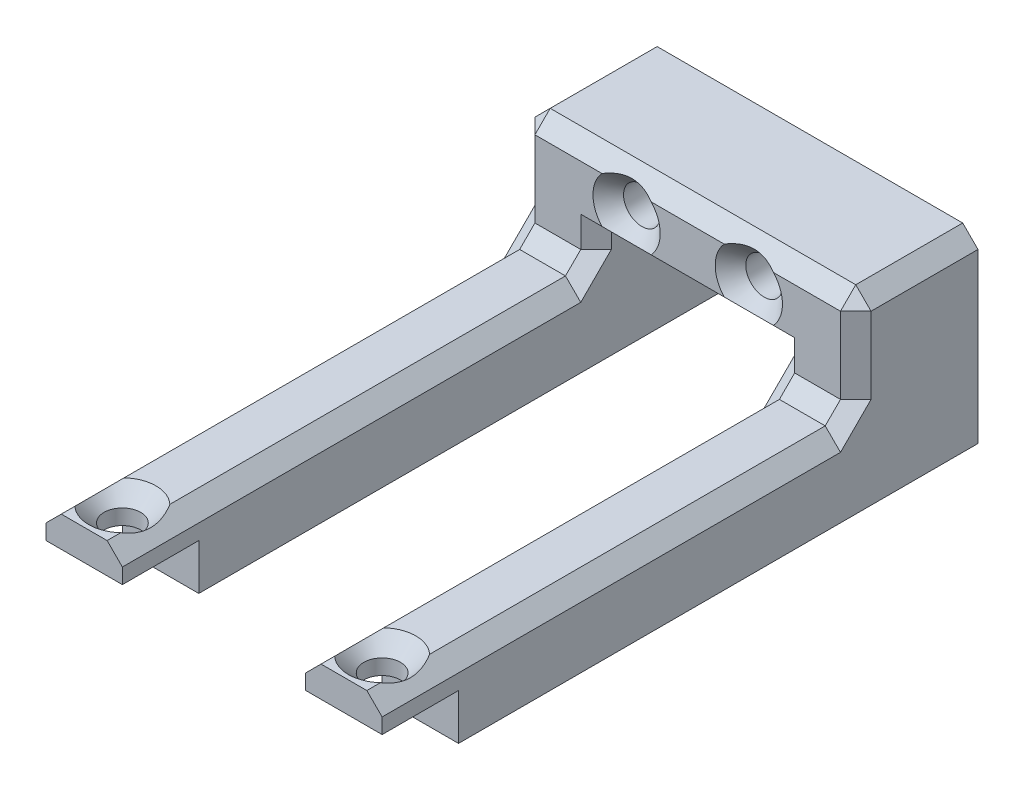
ISO-10303-21;
HEADER;
FILE_DESCRIPTION(('STEP AP214'),'2;1');
FILE_NAME('part.step','',(''),(''),'','','');
FILE_SCHEMA(('AUTOMOTIVE_DESIGN { 1 0 10303 214 1 1 1 1 }'));
ENDSEC;
DATA;
#1=APPLICATION_CONTEXT('core data for automotive mechanical design processes');
#2=APPLICATION_PROTOCOL_DEFINITION('international standard','automotive_design',2000,#1);
#3=PRODUCT_CONTEXT('',#1,'mechanical');
#4=PRODUCT('Part','Part','',(#3));
#5=PRODUCT_RELATED_PRODUCT_CATEGORY('part','',(#4));
#6=PRODUCT_DEFINITION_FORMATION('','',#4);
#7=PRODUCT_DEFINITION_CONTEXT('part definition',#1,'design');
#8=PRODUCT_DEFINITION('design','',#6,#7);
#9=PRODUCT_DEFINITION_SHAPE('','',#8);
#10=(LENGTH_UNIT() NAMED_UNIT(*) SI_UNIT(.MILLI.,.METRE.));
#11=(NAMED_UNIT(*) PLANE_ANGLE_UNIT() SI_UNIT($,.RADIAN.));
#12=(NAMED_UNIT(*) SI_UNIT($,.STERADIAN.) SOLID_ANGLE_UNIT());
#13=UNCERTAINTY_MEASURE_WITH_UNIT(LENGTH_MEASURE(1.E-05),#10,'distance_accuracy_value','');
#14=(GEOMETRIC_REPRESENTATION_CONTEXT(3) GLOBAL_UNCERTAINTY_ASSIGNED_CONTEXT((#13)) GLOBAL_UNIT_ASSIGNED_CONTEXT((#10,
#11,#12)) REPRESENTATION_CONTEXT('',''));
#15=CARTESIAN_POINT('',(0.,0.,0.));
#16=DIRECTION('',(0.,0.,1.));
#17=DIRECTION('',(1.,0.,0.));
#18=AXIS2_PLACEMENT_3D('',#15,#16,#17);
#19=CARTESIAN_POINT('',(22.,15.,8.));
#20=DIRECTION('',(0.,-1.,0.));
#21=DIRECTION('',(0.,0.,-1.));
#22=AXIS2_PLACEMENT_3D('',#19,#20,#21);
#23=PLANE('',#22);
#24=CARTESIAN_POINT('',(19.5,15.,36.5));
#25=DIRECTION('',(0.,1.,0.));
#26=DIRECTION('',(0.,0.,1.));
#27=AXIS2_PLACEMENT_3D('',#24,#25,#26);
#28=CIRCLE('',#27,2.2);
#29=CARTESIAN_POINT('',(18.,15.,38.1093476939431));
#30=VERTEX_POINT('',#29);
#31=CARTESIAN_POINT('',(21.,15.,38.1093476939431));
#32=VERTEX_POINT('',#31);
#33=EDGE_CURVE('E450',#30,#32,#28,.T.);
#34=ORIENTED_EDGE('',*,*,#33,.F.);
#35=DIRECTION('',(0.,0.,1.));
#36=VECTOR('',#35,1.);
#37=CARTESIAN_POINT('',(18.,15.,8.));
#38=LINE('',#37,#36);
#39=CARTESIAN_POINT('',(18.,15.,39.));
#40=VERTEX_POINT('',#39);
#41=EDGE_CURVE('E865',#30,#40,#38,.T.);
#42=ORIENTED_EDGE('',*,*,#41,.T.);
#43=DIRECTION('',(-1.,0.,0.));
#44=VECTOR('',#43,1.);
#45=CARTESIAN_POINT('',(17.,15.,39.));
#46=LINE('',#45,#44);
#47=CARTESIAN_POINT('',(21.,15.,39.));
#48=VERTEX_POINT('',#47);
#49=EDGE_CURVE('E325',#48,#40,#46,.T.);
#50=ORIENTED_EDGE('',*,*,#49,.F.);
#51=DIRECTION('',(0.,0.,-1.));
#52=VECTOR('',#51,1.);
#53=CARTESIAN_POINT('',(21.,15.,8.));
#54=LINE('',#53,#52);
#55=EDGE_CURVE('E861',#48,#32,#54,.T.);
#56=ORIENTED_EDGE('',*,*,#55,.T.);
#57=EDGE_LOOP('',(#34,#42,#50,#56));
#58=FACE_BOUND('',#57,.T.);
#59=ADVANCED_FACE('F41',(#58),#23,.F.);
#60=CARTESIAN_POINT('',(22.,0.,34.));
#61=DIRECTION('',(-1.,0.,0.));
#62=DIRECTION('',(0.,0.,1.));
#63=AXIS2_PLACEMENT_3D('',#60,#61,#62);
#64=PLANE('',#63);
#65=DIRECTION('',(0.,1.,0.));
#66=VECTOR('',#65,1.);
#67=CARTESIAN_POINT('',(22.,0.,0.));
#68=LINE('',#67,#66);
#69=CARTESIAN_POINT('',(22.,10.,0.));
#70=VERTEX_POINT('',#69);
#71=CARTESIAN_POINT('',(22.,21.,0.));
#72=VERTEX_POINT('',#71);
#73=EDGE_CURVE('E430',#70,#72,#68,.T.);
#74=ORIENTED_EDGE('',*,*,#73,.T.);
#75=DIRECTION('',(0.,0.,1.));
#76=VECTOR('',#75,1.);
#77=CARTESIAN_POINT('',(22.,21.,34.));
#78=LINE('',#77,#76);
#79=CARTESIAN_POINT('',(22.,21.,7.));
#80=VERTEX_POINT('',#79);
#81=EDGE_CURVE('E875',#72,#80,#78,.T.);
#82=ORIENTED_EDGE('',*,*,#81,.T.);
#83=DIRECTION('',(0.,-1.,0.));
#84=VECTOR('',#83,1.);
#85=CARTESIAN_POINT('',(22.,0.,7.));
#86=LINE('',#85,#84);
#87=CARTESIAN_POINT('',(22.,16.,7.));
#88=VERTEX_POINT('',#87);
#89=EDGE_CURVE('E878',#80,#88,#86,.T.);
#90=ORIENTED_EDGE('',*,*,#89,.T.);
#91=DIRECTION('',(0.,0.707106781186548,-0.707106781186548));
#92=VECTOR('',#91,1.);
#93=CARTESIAN_POINT('',(22.,16.,7.));
#94=LINE('',#93,#92);
#95=CARTESIAN_POINT('',(22.,15.,8.));
#96=VERTEX_POINT('',#95);
#97=EDGE_CURVE('E881',#96,#88,#94,.T.);
#98=ORIENTED_EDGE('',*,*,#97,.F.);
#99=DIRECTION('',(0.,0.707106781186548,-0.707106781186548));
#100=VECTOR('',#99,1.);
#101=CARTESIAN_POINT('',(22.,16.,7.));
#102=LINE('',#101,#100);
#103=CARTESIAN_POINT('',(22.,14.,9.));
#104=VERTEX_POINT('',#103);
#105=EDGE_CURVE('E885',#104,#96,#102,.T.);
#106=ORIENTED_EDGE('',*,*,#105,.F.);
#107=DIRECTION('',(0.,0.,1.));
#108=VECTOR('',#107,1.);
#109=CARTESIAN_POINT('',(22.,14.,34.));
#110=LINE('',#109,#108);
#111=CARTESIAN_POINT('',(22.,14.,39.));
#112=VERTEX_POINT('',#111);
#113=EDGE_CURVE('E854',#104,#112,#110,.T.);
#114=ORIENTED_EDGE('',*,*,#113,.T.);
#115=DIRECTION('',(0.,1.,0.));
#116=VECTOR('',#115,1.);
#117=CARTESIAN_POINT('',(22.,15.,39.));
#118=LINE('',#117,#116);
#119=CARTESIAN_POINT('',(22.,13.,39.));
#120=VERTEX_POINT('',#119);
#121=EDGE_CURVE('E311',#120,#112,#118,.T.);
#122=ORIENTED_EDGE('',*,*,#121,.F.);
#123=DIRECTION('',(0.,0.,-1.));
#124=VECTOR('',#123,1.);
#125=CARTESIAN_POINT('',(22.,13.,39.));
#126=LINE('',#125,#124);
#127=CARTESIAN_POINT('',(22.,13.,34.));
#128=VERTEX_POINT('',#127);
#129=EDGE_CURVE('E308',#120,#128,#126,.T.);
#130=ORIENTED_EDGE('',*,*,#129,.T.);
#131=DIRECTION('',(0.,1.,0.));
#132=VECTOR('',#131,1.);
#133=CARTESIAN_POINT('',(22.,0.,34.));
#134=LINE('',#133,#132);
#135=CARTESIAN_POINT('',(22.,10.,34.));
#136=VERTEX_POINT('',#135);
#137=EDGE_CURVE('E423',#136,#128,#134,.T.);
#138=ORIENTED_EDGE('',*,*,#137,.F.);
#139=DIRECTION('',(0.,0.,1.));
#140=VECTOR('',#139,1.);
#141=CARTESIAN_POINT('',(22.,10.,0.));
#142=LINE('',#141,#140);
#143=EDGE_CURVE('E381',#70,#136,#142,.T.);
#144=ORIENTED_EDGE('',*,*,#143,.F.);
#145=EDGE_LOOP('',(#74,#82,#90,#98,#106,#114,#122,#130,#138,#144));
#146=FACE_BOUND('',#145,.T.);
#147=ADVANCED_FACE('F653',(#146),#64,.F.);
#148=CARTESIAN_POINT('',(22.,22.,8.));
#149=DIRECTION('',(0.,0.,-1.));
#150=DIRECTION('',(-1.,0.,0.));
#151=AXIS2_PLACEMENT_3D('',#148,#149,#150);
#152=PLANE('',#151);
#153=CARTESIAN_POINT('',(7.,19.5,8.));
#154=DIRECTION('',(0.,0.,1.));
#155=DIRECTION('',(1.,0.,0.));
#156=AXIS2_PLACEMENT_3D('',#153,#154,#155);
#157=CIRCLE('',#156,2.2);
#158=CARTESIAN_POINT('',(8.6093476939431,18.,8.));
#159=VERTEX_POINT('',#158);
#160=CARTESIAN_POINT('',(8.60934769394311,21.,8.));
#161=VERTEX_POINT('',#160);
#162=EDGE_CURVE('E350',#159,#161,#157,.T.);
#163=ORIENTED_EDGE('',*,*,#162,.F.);
#164=DIRECTION('',(1.,0.,0.));
#165=VECTOR('',#164,1.);
#166=CARTESIAN_POINT('',(22.,18.,8.));
#167=LINE('',#166,#165);
#168=CARTESIAN_POINT('',(13.3906523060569,18.,8.));
#169=VERTEX_POINT('',#168);
#170=EDGE_CURVE('E911',#159,#169,#167,.T.);
#171=ORIENTED_EDGE('',*,*,#170,.T.);
#172=CARTESIAN_POINT('',(15.,19.5,8.));
#173=DIRECTION('',(0.,0.,1.));
#174=DIRECTION('',(1.,0.,0.));
#175=AXIS2_PLACEMENT_3D('',#172,#173,#174);
#176=CIRCLE('',#175,2.2);
#177=CARTESIAN_POINT('',(13.3906523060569,21.,8.));
#178=VERTEX_POINT('',#177);
#179=EDGE_CURVE('E367',#178,#169,#176,.T.);
#180=ORIENTED_EDGE('',*,*,#179,.F.);
#181=DIRECTION('',(-1.,0.,0.));
#182=VECTOR('',#181,1.);
#183=CARTESIAN_POINT('',(22.,21.,8.));
#184=LINE('',#183,#182);
#185=EDGE_CURVE('E913',#178,#161,#184,.T.);
#186=ORIENTED_EDGE('',*,*,#185,.T.);
#187=EDGE_LOOP('',(#163,#171,#180,#186));
#188=FACE_BOUND('',#187,.T.);
#189=ADVANCED_FACE('F624',(#188),#152,.F.);
#190=DIRECTION('',(0.,1.,0.));
#191=VECTOR('',#190,1.);
#192=CARTESIAN_POINT('',(4.,22.,8.));
#193=LINE('',#192,#191);
#194=CARTESIAN_POINT('',(4.,16.,8.));
#195=VERTEX_POINT('',#194);
#196=CARTESIAN_POINT('',(4.,18.,8.));
#197=VERTEX_POINT('',#196);
#198=EDGE_CURVE('E919',#195,#197,#193,.T.);
#199=ORIENTED_EDGE('',*,*,#198,.T.);
#200=DIRECTION('',(1.,0.,0.));
#201=VECTOR('',#200,1.);
#202=CARTESIAN_POINT('',(22.,18.,8.));
#203=LINE('',#202,#201);
#204=CARTESIAN_POINT('',(5.39065230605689,18.,8.));
#205=VERTEX_POINT('',#204);
#206=EDGE_CURVE('E916',#197,#205,#203,.T.);
#207=ORIENTED_EDGE('',*,*,#206,.T.);
#208=CARTESIAN_POINT('',(5.39065230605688,21.,8.));
#209=VERTEX_POINT('',#208);
#210=EDGE_CURVE('E354',#209,#205,#157,.T.);
#211=ORIENTED_EDGE('',*,*,#210,.F.);
#212=DIRECTION('',(-1.,0.,0.));
#213=VECTOR('',#212,1.);
#214=CARTESIAN_POINT('',(22.,21.,8.));
#215=LINE('',#214,#213);
#216=CARTESIAN_POINT('',(1.,21.,8.));
#217=VERTEX_POINT('',#216);
#218=EDGE_CURVE('E928',#209,#217,#215,.T.);
#219=ORIENTED_EDGE('',*,*,#218,.T.);
#220=DIRECTION('',(0.,-1.,0.));
#221=VECTOR('',#220,1.);
#222=CARTESIAN_POINT('',(1.,22.,8.));
#223=LINE('',#222,#221);
#224=CARTESIAN_POINT('',(1.,16.,8.));
#225=VERTEX_POINT('',#224);
#226=EDGE_CURVE('E925',#217,#225,#223,.T.);
#227=ORIENTED_EDGE('',*,*,#226,.T.);
#228=DIRECTION('',(1.,0.,0.));
#229=VECTOR('',#228,1.);
#230=CARTESIAN_POINT('',(5.,16.,8.));
#231=LINE('',#230,#229);
#232=EDGE_CURVE('E922',#225,#195,#231,.T.);
#233=ORIENTED_EDGE('',*,*,#232,.T.);
#234=EDGE_LOOP('',(#199,#207,#211,#219,#227,#233));
#235=FACE_BOUND('',#234,.T.);
#236=ADVANCED_FACE('F625',(#235),#152,.F.);
#237=CARTESIAN_POINT('',(0.,0.,34.));
#238=DIRECTION('',(1.,0.,0.));
#239=DIRECTION('',(0.,0.,-1.));
#240=AXIS2_PLACEMENT_3D('',#237,#238,#239);
#241=PLANE('',#240);
#242=DIRECTION('',(0.,-1.,0.));
#243=VECTOR('',#242,1.);
#244=CARTESIAN_POINT('',(0.,15.,39.));
#245=LINE('',#244,#243);
#246=CARTESIAN_POINT('',(0.,14.,39.));
#247=VERTEX_POINT('',#246);
#248=CARTESIAN_POINT('',(0.,13.,39.));
#249=VERTEX_POINT('',#248);
#250=EDGE_CURVE('E323',#247,#249,#245,.T.);
#251=ORIENTED_EDGE('',*,*,#250,.F.);
#252=DIRECTION('',(0.,0.,-1.));
#253=VECTOR('',#252,1.);
#254=CARTESIAN_POINT('',(0.,14.,34.));
#255=LINE('',#254,#253);
#256=CARTESIAN_POINT('',(0.,14.,9.));
#257=VERTEX_POINT('',#256);
#258=EDGE_CURVE('E961',#247,#257,#255,.T.);
#259=ORIENTED_EDGE('',*,*,#258,.T.);
#260=DIRECTION('',(0.,-0.707106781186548,0.707106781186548));
#261=VECTOR('',#260,1.);
#262=CARTESIAN_POINT('',(0.,14.,9.));
#263=LINE('',#262,#261);
#264=CARTESIAN_POINT('',(0.,15.,8.));
#265=VERTEX_POINT('',#264);
#266=EDGE_CURVE('E964',#265,#257,#263,.T.);
#267=ORIENTED_EDGE('',*,*,#266,.F.);
#268=DIRECTION('',(0.,-0.707106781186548,0.707106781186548));
#269=VECTOR('',#268,1.);
#270=CARTESIAN_POINT('',(0.,14.,9.));
#271=LINE('',#270,#269);
#272=CARTESIAN_POINT('',(0.,16.,7.));
#273=VERTEX_POINT('',#272);
#274=EDGE_CURVE('E968',#273,#265,#271,.T.);
#275=ORIENTED_EDGE('',*,*,#274,.F.);
#276=DIRECTION('',(0.,1.,0.));
#277=VECTOR('',#276,1.);
#278=CARTESIAN_POINT('',(0.,0.,7.));
#279=LINE('',#278,#277);
#280=CARTESIAN_POINT('',(0.,21.,7.));
#281=VERTEX_POINT('',#280);
#282=EDGE_CURVE('E972',#273,#281,#279,.T.);
#283=ORIENTED_EDGE('',*,*,#282,.T.);
#284=DIRECTION('',(0.,0.,-1.));
#285=VECTOR('',#284,1.);
#286=CARTESIAN_POINT('',(0.,21.,34.));
#287=LINE('',#286,#285);
#288=CARTESIAN_POINT('',(0.,21.,0.));
#289=VERTEX_POINT('',#288);
#290=EDGE_CURVE('E975',#281,#289,#287,.T.);
#291=ORIENTED_EDGE('',*,*,#290,.T.);
#292=DIRECTION('',(0.,-1.,0.));
#293=VECTOR('',#292,1.);
#294=CARTESIAN_POINT('',(0.,0.,0.));
#295=LINE('',#294,#293);
#296=CARTESIAN_POINT('',(0.,10.,0.));
#297=VERTEX_POINT('',#296);
#298=EDGE_CURVE('E417',#289,#297,#295,.T.);
#299=ORIENTED_EDGE('',*,*,#298,.T.);
#300=DIRECTION('',(0.,0.,1.));
#301=VECTOR('',#300,1.);
#302=CARTESIAN_POINT('',(0.,10.,0.));
#303=LINE('',#302,#301);
#304=CARTESIAN_POINT('',(0.,10.,34.));
#305=VERTEX_POINT('',#304);
#306=EDGE_CURVE('E387',#297,#305,#303,.T.);
#307=ORIENTED_EDGE('',*,*,#306,.T.);
#308=DIRECTION('',(0.,-1.,0.));
#309=VECTOR('',#308,1.);
#310=CARTESIAN_POINT('',(0.,0.,34.));
#311=LINE('',#310,#309);
#312=CARTESIAN_POINT('',(0.,13.,34.));
#313=VERTEX_POINT('',#312);
#314=EDGE_CURVE('E420',#313,#305,#311,.T.);
#315=ORIENTED_EDGE('',*,*,#314,.F.);
#316=DIRECTION('',(0.,0.,-1.));
#317=VECTOR('',#316,1.);
#318=CARTESIAN_POINT('',(0.,13.,39.));
#319=LINE('',#318,#317);
#320=EDGE_CURVE('E346',#249,#313,#319,.T.);
#321=ORIENTED_EDGE('',*,*,#320,.F.);
#322=EDGE_LOOP('',(#251,#259,#267,#275,#283,#291,#299,#307,#315,#321));
#323=FACE_BOUND('',#322,.T.);
#324=ADVANCED_FACE('F657',(#323),#241,.F.);
#325=DIRECTION('',(-1.,0.,0.));
#326=VECTOR('',#325,1.);
#327=CARTESIAN_POINT('',(0.,15.,39.));
#328=LINE('',#327,#326);
#329=CARTESIAN_POINT('',(4.,15.,39.));
#330=VERTEX_POINT('',#329);
#331=CARTESIAN_POINT('',(1.,15.,39.));
#332=VERTEX_POINT('',#331);
#333=EDGE_CURVE('E338',#330,#332,#328,.T.);
#334=ORIENTED_EDGE('',*,*,#333,.F.);
#335=DIRECTION('',(0.,0.,-1.));
#336=VECTOR('',#335,1.);
#337=CARTESIAN_POINT('',(4.,15.,8.));
#338=LINE('',#337,#336);
#339=CARTESIAN_POINT('',(4.,15.,38.1093476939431));
#340=VERTEX_POINT('',#339);
#341=EDGE_CURVE('E484',#330,#340,#338,.T.);
#342=ORIENTED_EDGE('',*,*,#341,.T.);
#343=CARTESIAN_POINT('',(2.5,15.,36.5));
#344=DIRECTION('',(0.,1.,0.));
#345=DIRECTION('',(0.,0.,1.));
#346=AXIS2_PLACEMENT_3D('',#343,#344,#345);
#347=CIRCLE('',#346,2.2);
#348=CARTESIAN_POINT('',(1.,15.,38.1093476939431));
#349=VERTEX_POINT('',#348);
#350=EDGE_CURVE('E748',#349,#340,#347,.T.);
#351=ORIENTED_EDGE('',*,*,#350,.F.);
#352=DIRECTION('',(0.,0.,1.));
#353=VECTOR('',#352,1.);
#354=CARTESIAN_POINT('',(1.,15.,8.));
#355=LINE('',#354,#353);
#356=EDGE_CURVE('E481',#349,#332,#355,.T.);
#357=ORIENTED_EDGE('',*,*,#356,.T.);
#358=EDGE_LOOP('',(#334,#342,#351,#357));
#359=FACE_BOUND('',#358,.T.);
#360=ADVANCED_FACE('F659',(#359),#23,.F.);
#361=CARTESIAN_POINT('',(0.,0.,34.));
#362=DIRECTION('',(0.,0.,-1.));
#363=DIRECTION('',(-1.,0.,0.));
#364=AXIS2_PLACEMENT_3D('',#361,#362,#363);
#365=PLANE('',#364);
#366=DIRECTION('',(1.,0.,0.));
#367=VECTOR('',#366,1.);
#368=CARTESIAN_POINT('',(17.,13.,34.));
#369=LINE('',#368,#367);
#370=CARTESIAN_POINT('',(17.,13.,34.));
#371=VERTEX_POINT('',#370);
#372=EDGE_CURVE('E300',#371,#128,#369,.T.);
#373=ORIENTED_EDGE('',*,*,#372,.F.);
#374=DIRECTION('',(0.,-1.,0.));
#375=VECTOR('',#374,1.);
#376=CARTESIAN_POINT('',(17.,0.,34.));
#377=LINE('',#376,#375);
#378=CARTESIAN_POINT('',(17.,10.,34.));
#379=VERTEX_POINT('',#378);
#380=EDGE_CURVE('E316',#371,#379,#377,.T.);
#381=ORIENTED_EDGE('',*,*,#380,.T.);
#382=DIRECTION('',(-1.,0.,0.));
#383=VECTOR('',#382,1.);
#384=CARTESIAN_POINT('',(0.,10.,34.));
#385=LINE('',#384,#383);
#386=EDGE_CURVE('E383',#136,#379,#385,.T.);
#387=ORIENTED_EDGE('',*,*,#386,.F.);
#388=ORIENTED_EDGE('',*,*,#137,.T.);
#389=EDGE_LOOP('',(#373,#381,#387,#388));
#390=FACE_BOUND('',#389,.T.);
#391=ADVANCED_FACE('F645',(#390),#365,.F.);
#392=DIRECTION('',(1.,0.,0.));
#393=VECTOR('',#392,1.);
#394=CARTESIAN_POINT('',(0.,13.,34.));
#395=LINE('',#394,#393);
#396=CARTESIAN_POINT('',(5.,13.,34.));
#397=VERTEX_POINT('',#396);
#398=EDGE_CURVE('E318',#313,#397,#395,.T.);
#399=ORIENTED_EDGE('',*,*,#398,.F.);
#400=ORIENTED_EDGE('',*,*,#314,.T.);
#401=CARTESIAN_POINT('',(5.,10.,34.));
#402=VERTEX_POINT('',#401);
#403=EDGE_CURVE('E376',#402,#305,#385,.T.);
#404=ORIENTED_EDGE('',*,*,#403,.F.);
#405=DIRECTION('',(0.,1.,0.));
#406=VECTOR('',#405,1.);
#407=CARTESIAN_POINT('',(5.,0.,34.));
#408=LINE('',#407,#406);
#409=EDGE_CURVE('E399',#402,#397,#408,.T.);
#410=ORIENTED_EDGE('',*,*,#409,.T.);
#411=EDGE_LOOP('',(#399,#400,#404,#410));
#412=FACE_BOUND('',#411,.T.);
#413=ADVANCED_FACE('F641',(#412),#365,.F.);
#414=CARTESIAN_POINT('',(0.,22.,34.));
#415=DIRECTION('',(0.,-1.,0.));
#416=DIRECTION('',(0.,0.,-1.));
#417=AXIS2_PLACEMENT_3D('',#414,#415,#416);
#418=PLANE('',#417);
#419=DIRECTION('',(-1.,0.,0.));
#420=VECTOR('',#419,1.);
#421=CARTESIAN_POINT('',(0.,22.,0.));
#422=LINE('',#421,#420);
#423=CARTESIAN_POINT('',(21.,22.,0.));
#424=VERTEX_POINT('',#423);
#425=CARTESIAN_POINT('',(1.,22.,0.));
#426=VERTEX_POINT('',#425);
#427=EDGE_CURVE('E424',#424,#426,#422,.T.);
#428=ORIENTED_EDGE('',*,*,#427,.T.);
#429=DIRECTION('',(0.,0.,1.));
#430=VECTOR('',#429,1.);
#431=CARTESIAN_POINT('',(1.,22.,34.));
#432=LINE('',#431,#430);
#433=CARTESIAN_POINT('',(1.,22.,7.));
#434=VERTEX_POINT('',#433);
#435=EDGE_CURVE('E891',#426,#434,#432,.T.);
#436=ORIENTED_EDGE('',*,*,#435,.T.);
#437=DIRECTION('',(1.,0.,0.));
#438=VECTOR('',#437,1.);
#439=CARTESIAN_POINT('',(0.,22.,7.));
#440=LINE('',#439,#438);
#441=CARTESIAN_POINT('',(21.,22.,7.));
#442=VERTEX_POINT('',#441);
#443=EDGE_CURVE('E894',#434,#442,#440,.T.);
#444=ORIENTED_EDGE('',*,*,#443,.T.);
#445=DIRECTION('',(0.,0.,-1.));
#446=VECTOR('',#445,1.);
#447=CARTESIAN_POINT('',(21.,22.,34.));
#448=LINE('',#447,#446);
#449=EDGE_CURVE('E897',#442,#424,#448,.T.);
#450=ORIENTED_EDGE('',*,*,#449,.T.);
#451=EDGE_LOOP('',(#428,#436,#444,#450));
#452=FACE_BOUND('',#451,.T.);
#453=ADVANCED_FACE('F644',(#452),#418,.F.);
#454=CARTESIAN_POINT('',(0.,0.,0.));
#455=DIRECTION('',(0.,0.,-1.));
#456=DIRECTION('',(-1.,0.,0.));
#457=AXIS2_PLACEMENT_3D('',#454,#455,#456);
#458=PLANE('',#457);
#459=CARTESIAN_POINT('',(7.,19.5,0.));
#460=DIRECTION('',(0.,0.,1.));
#461=DIRECTION('',(1.,0.,0.));
#462=AXIS2_PLACEMENT_3D('',#459,#460,#461);
#463=CIRCLE('',#462,1.2);
#464=CARTESIAN_POINT('',(8.2,19.5,0.));
#465=VERTEX_POINT('',#464);
#466=EDGE_CURVE('E359',#465,#465,#463,.T.);
#467=ORIENTED_EDGE('',*,*,#466,.T.);
#468=EDGE_LOOP('',(#467));
#469=FACE_BOUND('',#468,.T.);
#470=CARTESIAN_POINT('',(15.,19.5,0.));
#471=DIRECTION('',(0.,0.,1.));
#472=DIRECTION('',(1.,0.,0.));
#473=AXIS2_PLACEMENT_3D('',#470,#471,#472);
#474=CIRCLE('',#473,1.2);
#475=CARTESIAN_POINT('',(16.2,19.5,0.));
#476=VERTEX_POINT('',#475);
#477=EDGE_CURVE('E372',#476,#476,#474,.T.);
#478=ORIENTED_EDGE('',*,*,#477,.T.);
#479=EDGE_LOOP('',(#478));
#480=FACE_BOUND('',#479,.T.);
#481=ORIENTED_EDGE('',*,*,#298,.F.);
#482=DIRECTION('',(-0.707106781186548,-0.707106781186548,0.));
#483=VECTOR('',#482,1.);
#484=CARTESIAN_POINT('',(-10.5,10.5,0.));
#485=LINE('',#484,#483);
#486=EDGE_CURVE('E900',#289,#426,#485,.F.);
#487=ORIENTED_EDGE('',*,*,#486,.T.);
#488=ORIENTED_EDGE('',*,*,#427,.F.);
#489=DIRECTION('',(-0.707106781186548,0.707106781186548,0.));
#490=VECTOR('',#489,1.);
#491=CARTESIAN_POINT('',(21.5,21.5,0.));
#492=LINE('',#491,#490);
#493=EDGE_CURVE('E903',#424,#72,#492,.F.);
#494=ORIENTED_EDGE('',*,*,#493,.T.);
#495=ORIENTED_EDGE('',*,*,#73,.F.);
#496=DIRECTION('',(-1.,0.,0.));
#497=VECTOR('',#496,1.);
#498=CARTESIAN_POINT('',(0.,10.,0.));
#499=LINE('',#498,#497);
#500=CARTESIAN_POINT('',(17.,10.,0.));
#501=VERTEX_POINT('',#500);
#502=EDGE_CURVE('E377',#70,#501,#499,.T.);
#503=ORIENTED_EDGE('',*,*,#502,.T.);
#504=DIRECTION('',(0.,-1.,0.));
#505=VECTOR('',#504,1.);
#506=CARTESIAN_POINT('',(17.,0.,0.));
#507=LINE('',#506,#505);
#508=CARTESIAN_POINT('',(17.,17.,0.));
#509=VERTEX_POINT('',#508);
#510=EDGE_CURVE('E396',#509,#501,#507,.T.);
#511=ORIENTED_EDGE('',*,*,#510,.F.);
#512=DIRECTION('',(1.,0.,0.));
#513=VECTOR('',#512,1.);
#514=CARTESIAN_POINT('',(17.,17.,0.));
#515=LINE('',#514,#513);
#516=CARTESIAN_POINT('',(5.,17.,0.));
#517=VERTEX_POINT('',#516);
#518=EDGE_CURVE('E400',#517,#509,#515,.T.);
#519=ORIENTED_EDGE('',*,*,#518,.F.);
#520=DIRECTION('',(0.,1.,0.));
#521=VECTOR('',#520,1.);
#522=CARTESIAN_POINT('',(5.,0.,0.));
#523=LINE('',#522,#521);
#524=CARTESIAN_POINT('',(5.,10.,0.));
#525=VERTEX_POINT('',#524);
#526=EDGE_CURVE('E407',#525,#517,#523,.T.);
#527=ORIENTED_EDGE('',*,*,#526,.F.);
#528=EDGE_CURVE('E382',#525,#297,#499,.T.);
#529=ORIENTED_EDGE('',*,*,#528,.T.);
#530=EDGE_LOOP('',(#481,#487,#488,#494,#495,#503,#511,#519,#527,#529));
#531=FACE_BOUND('',#530,.T.);
#532=ADVANCED_FACE('F640',(#469,#480,#531),#458,.T.);
#533=CARTESIAN_POINT('',(17.,0.,34.));
#534=DIRECTION('',(1.,0.,0.));
#535=DIRECTION('',(0.,0.,-1.));
#536=AXIS2_PLACEMENT_3D('',#533,#534,#535);
#537=PLANE('',#536);
#538=DIRECTION('',(0.,-0.707106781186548,0.707106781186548));
#539=VECTOR('',#538,1.);
#540=CARTESIAN_POINT('',(17.,14.,9.));
#541=LINE('',#540,#539);
#542=CARTESIAN_POINT('',(17.,16.,7.));
#543=VERTEX_POINT('',#542);
#544=CARTESIAN_POINT('',(17.,15.,8.));
#545=VERTEX_POINT('',#544);
#546=EDGE_CURVE('E953',#543,#545,#541,.T.);
#547=ORIENTED_EDGE('',*,*,#546,.F.);
#548=DIRECTION('',(0.,1.,0.));
#549=VECTOR('',#548,1.);
#550=CARTESIAN_POINT('',(17.,0.,7.));
#551=LINE('',#550,#549);
#552=CARTESIAN_POINT('',(17.,17.,7.));
#553=VERTEX_POINT('',#552);
#554=EDGE_CURVE('E947',#543,#553,#551,.T.);
#555=ORIENTED_EDGE('',*,*,#554,.T.);
#556=DIRECTION('',(0.,0.,-1.));
#557=VECTOR('',#556,1.);
#558=CARTESIAN_POINT('',(17.,17.,34.));
#559=LINE('',#558,#557);
#560=EDGE_CURVE('E414',#553,#509,#559,.T.);
#561=ORIENTED_EDGE('',*,*,#560,.T.);
#562=ORIENTED_EDGE('',*,*,#510,.T.);
#563=DIRECTION('',(0.,0.,1.));
#564=VECTOR('',#563,1.);
#565=CARTESIAN_POINT('',(17.,10.,34.));
#566=LINE('',#565,#564);
#567=EDGE_CURVE('E391',#501,#379,#566,.T.);
#568=ORIENTED_EDGE('',*,*,#567,.T.);
#569=ORIENTED_EDGE('',*,*,#380,.F.);
#570=DIRECTION('',(0.,0.,-1.));
#571=VECTOR('',#570,1.);
#572=CARTESIAN_POINT('',(17.,13.,39.));
#573=LINE('',#572,#571);
#574=CARTESIAN_POINT('',(17.,13.,39.));
#575=VERTEX_POINT('',#574);
#576=EDGE_CURVE('E306',#575,#371,#573,.T.);
#577=ORIENTED_EDGE('',*,*,#576,.F.);
#578=DIRECTION('',(0.,-1.,0.));
#579=VECTOR('',#578,1.);
#580=CARTESIAN_POINT('',(17.,15.,39.));
#581=LINE('',#580,#579);
#582=CARTESIAN_POINT('',(17.,14.,39.));
#583=VERTEX_POINT('',#582);
#584=EDGE_CURVE('E288',#583,#575,#581,.T.);
#585=ORIENTED_EDGE('',*,*,#584,.F.);
#586=DIRECTION('',(0.,0.,-1.));
#587=VECTOR('',#586,1.);
#588=CARTESIAN_POINT('',(17.,14.,34.));
#589=LINE('',#588,#587);
#590=CARTESIAN_POINT('',(17.,14.,9.));
#591=VERTEX_POINT('',#590);
#592=EDGE_CURVE('E950',#583,#591,#589,.T.);
#593=ORIENTED_EDGE('',*,*,#592,.T.);
#594=DIRECTION('',(0.,-0.707106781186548,0.707106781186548));
#595=VECTOR('',#594,1.);
#596=CARTESIAN_POINT('',(17.,14.,9.));
#597=LINE('',#596,#595);
#598=EDGE_CURVE('E957',#545,#591,#597,.T.);
#599=ORIENTED_EDGE('',*,*,#598,.F.);
#600=EDGE_LOOP('',(#547,#555,#561,#562,#568,#569,#577,#585,#593,#599));
#601=FACE_BOUND('',#600,.T.);
#602=ADVANCED_FACE('F314',(#601),#537,.F.);
#603=CARTESIAN_POINT('',(17.,17.,34.));
#604=DIRECTION('',(0.,1.,0.));
#605=DIRECTION('',(0.,0.,1.));
#606=AXIS2_PLACEMENT_3D('',#603,#604,#605);
#607=PLANE('',#606);
#608=ORIENTED_EDGE('',*,*,#560,.F.);
#609=DIRECTION('',(-1.,0.,0.));
#610=VECTOR('',#609,1.);
#611=CARTESIAN_POINT('',(17.,17.,7.));
#612=LINE('',#611,#610);
#613=CARTESIAN_POINT('',(5.,17.,7.));
#614=VERTEX_POINT('',#613);
#615=EDGE_CURVE('E909',#553,#614,#612,.T.);
#616=ORIENTED_EDGE('',*,*,#615,.T.);
#617=DIRECTION('',(0.,0.,-1.));
#618=VECTOR('',#617,1.);
#619=CARTESIAN_POINT('',(5.,17.,34.));
#620=LINE('',#619,#618);
#621=EDGE_CURVE('E403',#614,#517,#620,.T.);
#622=ORIENTED_EDGE('',*,*,#621,.T.);
#623=ORIENTED_EDGE('',*,*,#518,.T.);
#624=EDGE_LOOP('',(#608,#616,#622,#623));
#625=FACE_BOUND('',#624,.T.);
#626=ADVANCED_FACE('F630',(#625),#607,.F.);
#627=CARTESIAN_POINT('',(5.,0.,34.));
#628=DIRECTION('',(-1.,0.,0.));
#629=DIRECTION('',(0.,0.,1.));
#630=AXIS2_PLACEMENT_3D('',#627,#628,#629);
#631=PLANE('',#630);
#632=DIRECTION('',(0.,0.707106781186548,-0.707106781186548));
#633=VECTOR('',#632,1.);
#634=CARTESIAN_POINT('',(5.,16.,7.));
#635=LINE('',#634,#633);
#636=CARTESIAN_POINT('',(5.,14.,9.));
#637=VERTEX_POINT('',#636);
#638=CARTESIAN_POINT('',(5.,15.,8.));
#639=VERTEX_POINT('',#638);
#640=EDGE_CURVE('E455',#637,#639,#635,.T.);
#641=ORIENTED_EDGE('',*,*,#640,.F.);
#642=DIRECTION('',(0.,0.,1.));
#643=VECTOR('',#642,1.);
#644=CARTESIAN_POINT('',(5.,14.,34.));
#645=LINE('',#644,#643);
#646=CARTESIAN_POINT('',(5.,14.,39.));
#647=VERTEX_POINT('',#646);
#648=EDGE_CURVE('E462',#637,#647,#645,.T.);
#649=ORIENTED_EDGE('',*,*,#648,.T.);
#650=DIRECTION('',(0.,1.,0.));
#651=VECTOR('',#650,1.);
#652=CARTESIAN_POINT('',(5.,15.,39.));
#653=LINE('',#652,#651);
#654=CARTESIAN_POINT('',(5.,13.,39.));
#655=VERTEX_POINT('',#654);
#656=EDGE_CURVE('E334',#655,#647,#653,.T.);
#657=ORIENTED_EDGE('',*,*,#656,.F.);
#658=DIRECTION('',(0.,0.,-1.));
#659=VECTOR('',#658,1.);
#660=CARTESIAN_POINT('',(5.,13.,39.));
#661=LINE('',#660,#659);
#662=EDGE_CURVE('E341',#655,#397,#661,.T.);
#663=ORIENTED_EDGE('',*,*,#662,.T.);
#664=ORIENTED_EDGE('',*,*,#409,.F.);
#665=DIRECTION('',(0.,0.,-1.));
#666=VECTOR('',#665,1.);
#667=CARTESIAN_POINT('',(5.,10.,34.));
#668=LINE('',#667,#666);
#669=EDGE_CURVE('E427',#402,#525,#668,.T.);
#670=ORIENTED_EDGE('',*,*,#669,.T.);
#671=ORIENTED_EDGE('',*,*,#526,.T.);
#672=ORIENTED_EDGE('',*,*,#621,.F.);
#673=DIRECTION('',(0.,-1.,0.));
#674=VECTOR('',#673,1.);
#675=CARTESIAN_POINT('',(5.,0.,7.));
#676=LINE('',#675,#674);
#677=CARTESIAN_POINT('',(5.,16.,7.));
#678=VERTEX_POINT('',#677);
#679=EDGE_CURVE('E459',#614,#678,#676,.T.);
#680=ORIENTED_EDGE('',*,*,#679,.T.);
#681=DIRECTION('',(0.,0.707106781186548,-0.707106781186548));
#682=VECTOR('',#681,1.);
#683=CARTESIAN_POINT('',(5.,16.,7.));
#684=LINE('',#683,#682);
#685=EDGE_CURVE('E440',#639,#678,#684,.T.);
#686=ORIENTED_EDGE('',*,*,#685,.F.);
#687=EDGE_LOOP('',(#641,#649,#657,#663,#664,#670,#671,#672,#680,#686));
#688=FACE_BOUND('',#687,.T.);
#689=ADVANCED_FACE('F633',(#688),#631,.F.);
#690=CARTESIAN_POINT('',(0.,10.,0.));
#691=DIRECTION('',(0.,1.,0.));
#692=DIRECTION('',(0.,0.,1.));
#693=AXIS2_PLACEMENT_3D('',#690,#691,#692);
#694=PLANE('',#693);
#695=ORIENTED_EDGE('',*,*,#403,.T.);
#696=ORIENTED_EDGE('',*,*,#306,.F.);
#697=ORIENTED_EDGE('',*,*,#528,.F.);
#698=ORIENTED_EDGE('',*,*,#669,.F.);
#699=EDGE_LOOP('',(#695,#696,#697,#698));
#700=FACE_BOUND('',#699,.T.);
#701=ADVANCED_FACE('F628',(#700),#694,.F.);
#702=ORIENTED_EDGE('',*,*,#502,.F.);
#703=ORIENTED_EDGE('',*,*,#143,.T.);
#704=ORIENTED_EDGE('',*,*,#386,.T.);
#705=ORIENTED_EDGE('',*,*,#567,.F.);
#706=EDGE_LOOP('',(#702,#703,#704,#705));
#707=FACE_BOUND('',#706,.T.);
#708=ADVANCED_FACE('F622',(#707),#694,.F.);
#709=CARTESIAN_POINT('',(16.6093476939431,18.,8.));
#710=VERTEX_POINT('',#709);
#711=CARTESIAN_POINT('',(16.6093476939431,21.,8.));
#712=VERTEX_POINT('',#711);
#713=EDGE_CURVE('E363',#710,#712,#176,.T.);
#714=ORIENTED_EDGE('',*,*,#713,.F.);
#715=DIRECTION('',(1.,0.,0.));
#716=VECTOR('',#715,1.);
#717=CARTESIAN_POINT('',(22.,18.,8.));
#718=LINE('',#717,#716);
#719=CARTESIAN_POINT('',(18.,18.,8.));
#720=VERTEX_POINT('',#719);
#721=EDGE_CURVE('E931',#710,#720,#718,.T.);
#722=ORIENTED_EDGE('',*,*,#721,.T.);
#723=DIRECTION('',(0.,-1.,0.));
#724=VECTOR('',#723,1.);
#725=CARTESIAN_POINT('',(18.,22.,8.));
#726=LINE('',#725,#724);
#727=CARTESIAN_POINT('',(18.,16.,8.));
#728=VERTEX_POINT('',#727);
#729=EDGE_CURVE('E934',#720,#728,#726,.T.);
#730=ORIENTED_EDGE('',*,*,#729,.T.);
#731=DIRECTION('',(1.,0.,0.));
#732=VECTOR('',#731,1.);
#733=CARTESIAN_POINT('',(22.,16.,8.));
#734=LINE('',#733,#732);
#735=CARTESIAN_POINT('',(21.,16.,8.));
#736=VERTEX_POINT('',#735);
#737=EDGE_CURVE('E944',#728,#736,#734,.T.);
#738=ORIENTED_EDGE('',*,*,#737,.T.);
#739=DIRECTION('',(0.,1.,0.));
#740=VECTOR('',#739,1.);
#741=CARTESIAN_POINT('',(21.,22.,8.));
#742=LINE('',#741,#740);
#743=CARTESIAN_POINT('',(21.,21.,8.));
#744=VERTEX_POINT('',#743);
#745=EDGE_CURVE('E941',#736,#744,#742,.T.);
#746=ORIENTED_EDGE('',*,*,#745,.T.);
#747=DIRECTION('',(-1.,0.,0.));
#748=VECTOR('',#747,1.);
#749=CARTESIAN_POINT('',(22.,21.,8.));
#750=LINE('',#749,#748);
#751=EDGE_CURVE('E938',#744,#712,#750,.T.);
#752=ORIENTED_EDGE('',*,*,#751,.T.);
#753=EDGE_LOOP('',(#714,#722,#730,#738,#746,#752));
#754=FACE_BOUND('',#753,.T.);
#755=ADVANCED_FACE('F619',(#754),#152,.F.);
#756=DIRECTION('',(-1.,0.,0.));
#757=VECTOR('',#756,1.);
#758=CARTESIAN_POINT('',(17.,15.,9.));
#759=LINE('',#758,#757);
#760=CARTESIAN_POINT('',(21.,15.,9.));
#761=VERTEX_POINT('',#760);
#762=CARTESIAN_POINT('',(18.,15.,9.));
#763=VERTEX_POINT('',#762);
#764=EDGE_CURVE('E60',#761,#763,#759,.T.);
#765=ORIENTED_EDGE('',*,*,#764,.T.);
#766=DIRECTION('',(0.,0.,1.));
#767=VECTOR('',#766,1.);
#768=CARTESIAN_POINT('',(18.,15.,8.));
#769=LINE('',#768,#767);
#770=CARTESIAN_POINT('',(18.,15.,34.8906523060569));
#771=VERTEX_POINT('',#770);
#772=EDGE_CURVE('E868',#763,#771,#769,.T.);
#773=ORIENTED_EDGE('',*,*,#772,.T.);
#774=CARTESIAN_POINT('',(21.,15.,34.8906523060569));
#775=VERTEX_POINT('',#774);
#776=EDGE_CURVE('E843',#775,#771,#28,.T.);
#777=ORIENTED_EDGE('',*,*,#776,.F.);
#778=DIRECTION('',(0.,0.,-1.));
#779=VECTOR('',#778,1.);
#780=CARTESIAN_POINT('',(21.,15.,8.));
#781=LINE('',#780,#779);
#782=EDGE_CURVE('E65',#775,#761,#781,.T.);
#783=ORIENTED_EDGE('',*,*,#782,.T.);
#784=EDGE_LOOP('',(#765,#773,#777,#783));
#785=FACE_BOUND('',#784,.T.);
#786=ADVANCED_FACE('F616',(#785),#23,.F.);
#787=CARTESIAN_POINT('',(4.,15.,34.8906523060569));
#788=VERTEX_POINT('',#787);
#789=CARTESIAN_POINT('',(1.,15.,34.8906523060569));
#790=VERTEX_POINT('',#789);
#791=EDGE_CURVE('E741',#788,#790,#347,.T.);
#792=ORIENTED_EDGE('',*,*,#791,.F.);
#793=DIRECTION('',(0.,0.,-1.));
#794=VECTOR('',#793,1.);
#795=CARTESIAN_POINT('',(4.,15.,8.));
#796=LINE('',#795,#794);
#797=CARTESIAN_POINT('',(4.,15.,9.));
#798=VERTEX_POINT('',#797);
#799=EDGE_CURVE('E478',#788,#798,#796,.T.);
#800=ORIENTED_EDGE('',*,*,#799,.T.);
#801=DIRECTION('',(-1.,0.,0.));
#802=VECTOR('',#801,1.);
#803=CARTESIAN_POINT('',(0.,15.,9.));
#804=LINE('',#803,#802);
#805=CARTESIAN_POINT('',(1.,15.,9.));
#806=VERTEX_POINT('',#805);
#807=EDGE_CURVE('E472',#798,#806,#804,.T.);
#808=ORIENTED_EDGE('',*,*,#807,.T.);
#809=DIRECTION('',(0.,0.,1.));
#810=VECTOR('',#809,1.);
#811=CARTESIAN_POINT('',(1.,15.,8.));
#812=LINE('',#811,#810);
#813=EDGE_CURVE('E475',#806,#790,#812,.T.);
#814=ORIENTED_EDGE('',*,*,#813,.T.);
#815=EDGE_LOOP('',(#792,#800,#808,#814));
#816=FACE_BOUND('',#815,.T.);
#817=ADVANCED_FACE('F614',(#816),#23,.F.);
#818=CARTESIAN_POINT('',(15.,19.5,8.));
#819=DIRECTION('',(0.,0.,1.));
#820=DIRECTION('',(1.,0.,0.));
#821=AXIS2_PLACEMENT_3D('',#818,#819,#820);
#822=CYLINDRICAL_SURFACE('',#821,1.2);
#823=ORIENTED_EDGE('',*,*,#477,.F.);
#824=EDGE_LOOP('',(#823));
#825=FACE_BOUND('',#824,.T.);
#826=CARTESIAN_POINT('',(15.,19.5,7.));
#827=DIRECTION('',(0.,0.,1.));
#828=DIRECTION('',(1.,0.,0.));
#829=AXIS2_PLACEMENT_3D('',#826,#827,#828);
#830=CIRCLE('',#829,1.2);
#831=CARTESIAN_POINT('',(16.2,19.5,7.));
#832=VERTEX_POINT('',#831);
#833=EDGE_CURVE('E368',#832,#832,#830,.T.);
#834=ORIENTED_EDGE('',*,*,#833,.T.);
#835=EDGE_LOOP('',(#834));
#836=FACE_BOUND('',#835,.T.);
#837=ADVANCED_FACE('F609',(#825,#836),#822,.F.);
#838=CARTESIAN_POINT('',(15.,19.5,8.));
#839=DIRECTION('',(0.,0.,1.));
#840=DIRECTION('',(1.,0.,0.));
#841=AXIS2_PLACEMENT_3D('',#838,#839,#840);
#842=CONICAL_SURFACE('',#841,2.2,0.785398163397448);
#843=ORIENTED_EDGE('',*,*,#833,.F.);
#844=EDGE_LOOP('',(#843));
#845=FACE_BOUND('',#844,.T.);
#846=ORIENTED_EDGE('',*,*,#179,.T.);
#847=CARTESIAN_POINT('',(13.3906523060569,18.,8.));
#848=CARTESIAN_POINT('',(13.47881135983,17.9616503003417,7.96165030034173));
#849=CARTESIAN_POINT('',(13.5690507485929,17.9255549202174,7.92555492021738));
#850=CARTESIAN_POINT('',(13.7537579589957,17.8587256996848,7.85872569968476));
#851=CARTESIAN_POINT('',(13.8482381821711,17.8280090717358,7.82800907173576));
#852=CARTESIAN_POINT('',(14.041114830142,17.7729930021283,7.77299300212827));
#853=CARTESIAN_POINT('',(14.139518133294,17.7487054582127,7.74870545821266));
#854=CARTESIAN_POINT('',(14.3393130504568,17.707642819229,7.70764281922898));
#855=CARTESIAN_POINT('',(14.4407003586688,17.6908574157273,7.6908574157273));
#856=CARTESIAN_POINT('',(14.6174911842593,17.6690227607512,7.66902276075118));
#857=CARTESIAN_POINT('',(14.6924189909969,17.6620194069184,7.66201940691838));
#858=CARTESIAN_POINT('',(14.8428434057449,17.6525739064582,7.65257390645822));
#859=CARTESIAN_POINT('',(14.9183399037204,17.6501308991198,7.6501308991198));
#860=CARTESIAN_POINT('',(15.0690872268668,17.6498797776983,7.64987977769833));
#861=CARTESIAN_POINT('',(15.1443380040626,17.6520557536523,7.65205575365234));
#862=CARTESIAN_POINT('',(15.2942953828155,17.660944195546,7.66094419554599));
#863=CARTESIAN_POINT('',(15.3690019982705,17.6676565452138,7.66765654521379));
#864=CARTESIAN_POINT('',(15.5171069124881,17.6853967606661,7.68539676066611));
#865=CARTESIAN_POINT('',(15.590508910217,17.6964092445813,7.69640924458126));
#866=CARTESIAN_POINT('',(15.7358774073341,17.7224624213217,7.72246242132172));
#867=CARTESIAN_POINT('',(15.8078432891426,17.737504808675,7.73750480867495));
#868=CARTESIAN_POINT('',(16.0213580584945,17.788233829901,7.78823382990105));
#869=CARTESIAN_POINT('',(16.1603275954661,17.8294973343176,7.82949733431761));
#870=CARTESIAN_POINT('',(16.3488306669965,17.895462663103,7.89546266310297));
#871=CARTESIAN_POINT('',(16.4019982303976,17.9152472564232,7.91524725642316));
#872=CARTESIAN_POINT('',(16.5067705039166,17.9564375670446,7.95643756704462));
#873=CARTESIAN_POINT('',(16.5583808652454,17.9778360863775,7.97783608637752));
#874=CARTESIAN_POINT('',(16.6093476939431,18.,8.));
#875=B_SPLINE_CURVE_WITH_KNOTS('',3,(#847,#848,#849,#850,#851,#852,#853,#854,#855,#856,#857,
#858,#859,#860,#861,#862,#863,#864,#865,#866,#867,#868,#869,#870,#871,#872,#873,#874),
.UNSPECIFIED.,.F.,.F.,(4,2,2,2,2,2,2,2,2,2,2,2,2,4),(0.,0.310601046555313,0.622178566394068,
0.934328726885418,1.24604864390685,1.47253137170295,1.69897134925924,1.92463262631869,
2.15028811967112,2.37514371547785,2.60009400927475,3.05058753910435,3.23079346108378,
3.41023846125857),.UNSPECIFIED.);
#876=EDGE_CURVE('E591',#169,#710,#875,.T.);
#877=ORIENTED_EDGE('',*,*,#876,.T.);
#878=ORIENTED_EDGE('',*,*,#713,.T.);
#879=CARTESIAN_POINT('',(16.6093476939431,21.,8.));
#880=CARTESIAN_POINT('',(16.52118864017,21.0383496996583,7.96165030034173));
#881=CARTESIAN_POINT('',(16.4309492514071,21.0744450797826,7.92555492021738));
#882=CARTESIAN_POINT('',(16.2462420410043,21.1412743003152,7.85872569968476));
#883=CARTESIAN_POINT('',(16.1517618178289,21.1719909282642,7.82800907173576));
#884=CARTESIAN_POINT('',(15.958885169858,21.2270069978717,7.77299300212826));
#885=CARTESIAN_POINT('',(15.860481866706,21.2512945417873,7.74870545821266));
#886=CARTESIAN_POINT('',(15.6606869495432,21.292357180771,7.70764281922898));
#887=CARTESIAN_POINT('',(15.5592996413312,21.3091425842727,7.69085741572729));
#888=CARTESIAN_POINT('',(15.3825088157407,21.3309772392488,7.66902276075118));
#889=CARTESIAN_POINT('',(15.3075810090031,21.3379805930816,7.66201940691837));
#890=CARTESIAN_POINT('',(15.1571565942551,21.3474260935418,7.65257390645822));
#891=CARTESIAN_POINT('',(15.0816600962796,21.3498691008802,7.6501308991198));
#892=CARTESIAN_POINT('',(14.9309127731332,21.3501202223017,7.64987977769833));
#893=CARTESIAN_POINT('',(14.8556619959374,21.3479442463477,7.65205575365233));
#894=CARTESIAN_POINT('',(14.7057046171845,21.339055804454,7.66094419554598));
#895=CARTESIAN_POINT('',(14.6309980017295,21.3323434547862,7.66765654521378));
#896=CARTESIAN_POINT('',(14.4828930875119,21.3146032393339,7.6853967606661));
#897=CARTESIAN_POINT('',(14.409491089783,21.3035907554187,7.69640924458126));
#898=CARTESIAN_POINT('',(14.2641225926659,21.2775375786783,7.72246242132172));
#899=CARTESIAN_POINT('',(14.1921567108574,21.262495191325,7.73750480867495));
#900=CARTESIAN_POINT('',(13.9786419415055,21.211766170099,7.78823382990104));
#901=CARTESIAN_POINT('',(13.8396724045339,21.1705026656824,7.8294973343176));
#902=CARTESIAN_POINT('',(13.6511693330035,21.104537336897,7.89546266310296));
#903=CARTESIAN_POINT('',(13.5980017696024,21.0847527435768,7.91524725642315));
#904=CARTESIAN_POINT('',(13.4932294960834,21.0435624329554,7.95643756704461));
#905=CARTESIAN_POINT('',(13.4416191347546,21.0221639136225,7.97783608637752));
#906=CARTESIAN_POINT('',(13.3906523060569,21.,8.));
#907=B_SPLINE_CURVE_WITH_KNOTS('',3,(#879,#880,#881,#882,#883,#884,#885,#886,#887,#888,#889,
#890,#891,#892,#893,#894,#895,#896,#897,#898,#899,#900,#901,#902,#903,#904,#905,#906),
.UNSPECIFIED.,.F.,.F.,(4,2,2,2,2,2,2,2,2,2,2,2,2,4),(0.,0.310601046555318,0.622178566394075,
0.934328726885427,1.24604864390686,1.47253137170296,1.69897134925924,1.9246326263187,
2.15028811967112,2.37514371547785,2.60009400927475,3.05058753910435,3.23079346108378,
3.41023846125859),.UNSPECIFIED.);
#908=EDGE_CURVE('E583',#712,#178,#907,.T.);
#909=ORIENTED_EDGE('',*,*,#908,.T.);
#910=EDGE_LOOP('',(#846,#877,#878,#909));
#911=FACE_BOUND('',#910,.T.);
#912=ADVANCED_FACE('F603',(#845,#911),#842,.F.);
#913=CARTESIAN_POINT('',(7.,19.5,8.));
#914=DIRECTION('',(0.,0.,1.));
#915=DIRECTION('',(1.,0.,0.));
#916=AXIS2_PLACEMENT_3D('',#913,#914,#915);
#917=CYLINDRICAL_SURFACE('',#916,1.2);
#918=ORIENTED_EDGE('',*,*,#466,.F.);
#919=EDGE_LOOP('',(#918));
#920=FACE_BOUND('',#919,.T.);
#921=CARTESIAN_POINT('',(7.,19.5,7.));
#922=DIRECTION('',(0.,0.,1.));
#923=DIRECTION('',(1.,0.,0.));
#924=AXIS2_PLACEMENT_3D('',#921,#922,#923);
#925=CIRCLE('',#924,1.2);
#926=CARTESIAN_POINT('',(8.2,19.5,7.));
#927=VERTEX_POINT('',#926);
#928=EDGE_CURVE('E355',#927,#927,#925,.T.);
#929=ORIENTED_EDGE('',*,*,#928,.T.);
#930=EDGE_LOOP('',(#929));
#931=FACE_BOUND('',#930,.T.);
#932=ADVANCED_FACE('F608',(#920,#931),#917,.F.);
#933=CARTESIAN_POINT('',(7.,19.5,8.));
#934=DIRECTION('',(0.,0.,1.));
#935=DIRECTION('',(1.,0.,0.));
#936=AXIS2_PLACEMENT_3D('',#933,#934,#935);
#937=CONICAL_SURFACE('',#936,2.2,0.785398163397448);
#938=ORIENTED_EDGE('',*,*,#928,.F.);
#939=EDGE_LOOP('',(#938));
#940=FACE_BOUND('',#939,.T.);
#941=ORIENTED_EDGE('',*,*,#210,.T.);
#942=CARTESIAN_POINT('',(5.39065230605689,18.,8.));
#943=CARTESIAN_POINT('',(5.47881135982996,17.9616503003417,7.96165030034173));
#944=CARTESIAN_POINT('',(5.56905074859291,17.9255549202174,7.92555492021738));
#945=CARTESIAN_POINT('',(5.75375795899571,17.8587256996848,7.85872569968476));
#946=CARTESIAN_POINT('',(5.84823818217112,17.8280090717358,7.82800907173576));
#947=CARTESIAN_POINT('',(6.04111483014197,17.7729930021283,7.77299300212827));
#948=CARTESIAN_POINT('',(6.13951813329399,17.7487054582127,7.74870545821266));
#949=CARTESIAN_POINT('',(6.33931305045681,17.707642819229,7.70764281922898));
#950=CARTESIAN_POINT('',(6.44070035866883,17.6908574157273,7.6908574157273));
#951=CARTESIAN_POINT('',(6.61749118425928,17.6690227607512,7.66902276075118));
#952=CARTESIAN_POINT('',(6.69241899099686,17.6620194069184,7.66201940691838));
#953=CARTESIAN_POINT('',(6.8428434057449,17.6525739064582,7.65257390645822));
#954=CARTESIAN_POINT('',(6.91833990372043,17.6501308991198,7.6501308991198));
#955=CARTESIAN_POINT('',(7.06908722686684,17.6498797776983,7.64987977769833));
#956=CARTESIAN_POINT('',(7.14433800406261,17.6520557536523,7.65205575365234));
#957=CARTESIAN_POINT('',(7.29429538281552,17.660944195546,7.66094419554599));
#958=CARTESIAN_POINT('',(7.36900199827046,17.6676565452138,7.66765654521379));
#959=CARTESIAN_POINT('',(7.51710691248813,17.6853967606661,7.6853967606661));
#960=CARTESIAN_POINT('',(7.59050891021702,17.6964092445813,7.69640924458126));
#961=CARTESIAN_POINT('',(7.73587740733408,17.7224624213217,7.72246242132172));
#962=CARTESIAN_POINT('',(7.80784328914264,17.737504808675,7.73750480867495));
#963=CARTESIAN_POINT('',(8.02135805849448,17.788233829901,7.78823382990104));
#964=CARTESIAN_POINT('',(8.16032759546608,17.8294973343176,7.82949733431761));
#965=CARTESIAN_POINT('',(8.34883066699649,17.895462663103,7.89546266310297));
#966=CARTESIAN_POINT('',(8.40199823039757,17.9152472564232,7.91524725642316));
#967=CARTESIAN_POINT('',(8.50677050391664,17.9564375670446,7.95643756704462));
#968=CARTESIAN_POINT('',(8.55838086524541,17.9778360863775,7.97783608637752));
#969=CARTESIAN_POINT('',(8.60934769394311,18.,8.));
#970=B_SPLINE_CURVE_WITH_KNOTS('',3,(#942,#943,#944,#945,#946,#947,#948,#949,#950,#951,#952,
#953,#954,#955,#956,#957,#958,#959,#960,#961,#962,#963,#964,#965,#966,#967,#968,#969),
.UNSPECIFIED.,.F.,.F.,(4,2,2,2,2,2,2,2,2,2,2,2,2,4),(0.,0.310601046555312,0.622178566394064,
0.934328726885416,1.24604864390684,1.47253137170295,1.69897134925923,1.92463262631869,
2.15028811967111,2.37514371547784,2.60009400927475,3.05058753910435,3.23079346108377,
3.41023846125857),.UNSPECIFIED.);
#971=EDGE_CURVE('E592',#205,#159,#970,.T.);
#972=ORIENTED_EDGE('',*,*,#971,.T.);
#973=ORIENTED_EDGE('',*,*,#162,.T.);
#974=CARTESIAN_POINT('',(8.60934769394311,21.,8.));
#975=CARTESIAN_POINT('',(8.52118864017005,21.0383496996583,7.96165030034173));
#976=CARTESIAN_POINT('',(8.43094925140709,21.0744450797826,7.92555492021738));
#977=CARTESIAN_POINT('',(8.2462420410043,21.1412743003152,7.85872569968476));
#978=CARTESIAN_POINT('',(8.15176181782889,21.1719909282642,7.82800907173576));
#979=CARTESIAN_POINT('',(7.95888516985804,21.2270069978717,7.77299300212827));
#980=CARTESIAN_POINT('',(7.86048186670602,21.2512945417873,7.74870545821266));
#981=CARTESIAN_POINT('',(7.6606869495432,21.292357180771,7.70764281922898));
#982=CARTESIAN_POINT('',(7.55929964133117,21.3091425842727,7.69085741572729));
#983=CARTESIAN_POINT('',(7.38250881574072,21.3309772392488,7.66902276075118));
#984=CARTESIAN_POINT('',(7.30758100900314,21.3379805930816,7.66201940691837));
#985=CARTESIAN_POINT('',(7.1571565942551,21.3474260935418,7.65257390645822));
#986=CARTESIAN_POINT('',(7.08166009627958,21.3498691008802,7.6501308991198));
#987=CARTESIAN_POINT('',(6.93091277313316,21.3501202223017,7.64987977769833));
#988=CARTESIAN_POINT('',(6.85566199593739,21.3479442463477,7.65205575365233));
#989=CARTESIAN_POINT('',(6.70570461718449,21.339055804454,7.66094419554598));
#990=CARTESIAN_POINT('',(6.63099800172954,21.3323434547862,7.66765654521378));
#991=CARTESIAN_POINT('',(6.48289308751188,21.3146032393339,7.6853967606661));
#992=CARTESIAN_POINT('',(6.40949108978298,21.3035907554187,7.69640924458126));
#993=CARTESIAN_POINT('',(6.26412259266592,21.2775375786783,7.72246242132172));
#994=CARTESIAN_POINT('',(6.19215671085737,21.2624951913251,7.73750480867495));
#995=CARTESIAN_POINT('',(5.97864194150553,21.211766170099,7.78823382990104));
#996=CARTESIAN_POINT('',(5.83967240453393,21.1705026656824,7.8294973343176));
#997=CARTESIAN_POINT('',(5.65116933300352,21.104537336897,7.89546266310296));
#998=CARTESIAN_POINT('',(5.59800176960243,21.0847527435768,7.91524725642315));
#999=CARTESIAN_POINT('',(5.49322949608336,21.0435624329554,7.95643756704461));
#1000=CARTESIAN_POINT('',(5.44161913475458,21.0221639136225,7.97783608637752));
#1001=CARTESIAN_POINT('',(5.39065230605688,21.,8.));
#1002=B_SPLINE_CURVE_WITH_KNOTS('',3,(#974,#975,#976,#977,#978,#979,#980,#981,#982,#983,#984,
#985,#986,#987,#988,#989,#990,#991,#992,#993,#994,#995,#996,#997,#998,#999,#1000,#1001),
.UNSPECIFIED.,.F.,.F.,(4,2,2,2,2,2,2,2,2,2,2,2,2,4),(0.,0.310601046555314,0.622178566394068,
0.934328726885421,1.24604864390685,1.47253137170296,1.69897134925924,1.9246326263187,
2.15028811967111,2.37514371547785,2.60009400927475,3.05058753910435,3.23079346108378,
3.41023846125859),.UNSPECIFIED.);
#1003=EDGE_CURVE('E574',#161,#209,#1002,.T.);
#1004=ORIENTED_EDGE('',*,*,#1003,.T.);
#1005=EDGE_LOOP('',(#941,#972,#973,#1004));
#1006=FACE_BOUND('',#1005,.T.);
#1007=ADVANCED_FACE('F989',(#940,#1006),#937,.F.);
#1008=CARTESIAN_POINT('',(0.,13.,39.));
#1009=DIRECTION('',(0.,1.,0.));
#1010=DIRECTION('',(0.,0.,1.));
#1011=AXIS2_PLACEMENT_3D('',#1008,#1009,#1010);
#1012=PLANE('',#1011);
#1013=CARTESIAN_POINT('',(2.5,13.,36.5));
#1014=DIRECTION('',(0.,1.,0.));
#1015=DIRECTION('',(0.,0.,1.));
#1016=AXIS2_PLACEMENT_3D('',#1013,#1014,#1015);
#1017=CIRCLE('',#1016,1.2);
#1018=CARTESIAN_POINT('',(2.5,13.,37.7));
#1019=VERTEX_POINT('',#1018);
#1020=EDGE_CURVE('E446',#1019,#1019,#1017,.T.);
#1021=ORIENTED_EDGE('',*,*,#1020,.T.);
#1022=EDGE_LOOP('',(#1021));
#1023=FACE_BOUND('',#1022,.T.);
#1024=ORIENTED_EDGE('',*,*,#398,.T.);
#1025=ORIENTED_EDGE('',*,*,#662,.F.);
#1026=DIRECTION('',(1.,0.,0.));
#1027=VECTOR('',#1026,1.);
#1028=CARTESIAN_POINT('',(0.,13.,39.));
#1029=LINE('',#1028,#1027);
#1030=EDGE_CURVE('E331',#249,#655,#1029,.T.);
#1031=ORIENTED_EDGE('',*,*,#1030,.F.);
#1032=ORIENTED_EDGE('',*,*,#320,.T.);
#1033=EDGE_LOOP('',(#1024,#1025,#1031,#1032));
#1034=FACE_BOUND('',#1033,.T.);
#1035=ADVANCED_FACE('F1082',(#1023,#1034),#1012,.F.);
#1036=CARTESIAN_POINT('',(0.,0.,39.));
#1037=DIRECTION('',(0.,0.,1.));
#1038=DIRECTION('',(1.,0.,0.));
#1039=AXIS2_PLACEMENT_3D('',#1036,#1037,#1038);
#1040=PLANE('',#1039);
#1041=ORIENTED_EDGE('',*,*,#656,.T.);
#1042=DIRECTION('',(0.707106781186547,-0.707106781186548,0.));
#1043=VECTOR('',#1042,1.);
#1044=CARTESIAN_POINT('',(9.5,9.49999999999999,39.));
#1045=LINE('',#1044,#1043);
#1046=EDGE_CURVE('E469',#647,#330,#1045,.F.);
#1047=ORIENTED_EDGE('',*,*,#1046,.T.);
#1048=ORIENTED_EDGE('',*,*,#333,.T.);
#1049=DIRECTION('',(0.707106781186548,0.707106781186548,0.));
#1050=VECTOR('',#1049,1.);
#1051=CARTESIAN_POINT('',(-7.,7.,39.));
#1052=LINE('',#1051,#1050);
#1053=EDGE_CURVE('E466',#332,#247,#1052,.F.);
#1054=ORIENTED_EDGE('',*,*,#1053,.T.);
#1055=ORIENTED_EDGE('',*,*,#250,.T.);
#1056=ORIENTED_EDGE('',*,*,#1030,.T.);
#1057=EDGE_LOOP('',(#1041,#1047,#1048,#1054,#1055,#1056));
#1058=FACE_BOUND('',#1057,.T.);
#1059=ADVANCED_FACE('F1088',(#1058),#1040,.T.);
#1060=CARTESIAN_POINT('',(17.,13.,39.));
#1061=DIRECTION('',(0.,1.,0.));
#1062=DIRECTION('',(0.,0.,1.));
#1063=AXIS2_PLACEMENT_3D('',#1060,#1061,#1062);
#1064=PLANE('',#1063);
#1065=CARTESIAN_POINT('',(19.5,13.,36.5));
#1066=DIRECTION('',(0.,1.,0.));
#1067=DIRECTION('',(0.,0.,1.));
#1068=AXIS2_PLACEMENT_3D('',#1065,#1066,#1067);
#1069=CIRCLE('',#1068,1.2);
#1070=CARTESIAN_POINT('',(19.5,13.,37.7));
#1071=VERTEX_POINT('',#1070);
#1072=EDGE_CURVE('E441',#1071,#1071,#1069,.T.);
#1073=ORIENTED_EDGE('',*,*,#1072,.T.);
#1074=EDGE_LOOP('',(#1073));
#1075=FACE_BOUND('',#1074,.T.);
#1076=ORIENTED_EDGE('',*,*,#372,.T.);
#1077=ORIENTED_EDGE('',*,*,#129,.F.);
#1078=DIRECTION('',(1.,0.,0.));
#1079=VECTOR('',#1078,1.);
#1080=CARTESIAN_POINT('',(17.,13.,39.));
#1081=LINE('',#1080,#1079);
#1082=EDGE_CURVE('E293',#575,#120,#1081,.T.);
#1083=ORIENTED_EDGE('',*,*,#1082,.F.);
#1084=ORIENTED_EDGE('',*,*,#576,.T.);
#1085=EDGE_LOOP('',(#1076,#1077,#1083,#1084));
#1086=FACE_BOUND('',#1085,.T.);
#1087=ADVANCED_FACE('F305',(#1075,#1086),#1064,.F.);
#1088=CARTESIAN_POINT('',(0.,0.,39.));
#1089=DIRECTION('',(0.,0.,1.));
#1090=DIRECTION('',(1.,0.,0.));
#1091=AXIS2_PLACEMENT_3D('',#1088,#1089,#1090);
#1092=PLANE('',#1091);
#1093=ORIENTED_EDGE('',*,*,#49,.T.);
#1094=DIRECTION('',(0.707106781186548,0.707106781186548,0.));
#1095=VECTOR('',#1094,1.);
#1096=CARTESIAN_POINT('',(1.5,-1.5,39.));
#1097=LINE('',#1096,#1095);
#1098=EDGE_CURVE('E11',#40,#583,#1097,.F.);
#1099=ORIENTED_EDGE('',*,*,#1098,.T.);
#1100=ORIENTED_EDGE('',*,*,#584,.T.);
#1101=ORIENTED_EDGE('',*,*,#1082,.T.);
#1102=ORIENTED_EDGE('',*,*,#121,.T.);
#1103=DIRECTION('',(0.707106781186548,-0.707106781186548,0.));
#1104=VECTOR('',#1103,1.);
#1105=CARTESIAN_POINT('',(18.,18.,39.));
#1106=LINE('',#1105,#1104);
#1107=EDGE_CURVE('E52',#112,#48,#1106,.F.);
#1108=ORIENTED_EDGE('',*,*,#1107,.T.);
#1109=EDGE_LOOP('',(#1093,#1099,#1100,#1101,#1102,#1108));
#1110=FACE_BOUND('',#1109,.T.);
#1111=ADVANCED_FACE('F291',(#1110),#1092,.T.);
#1112=CARTESIAN_POINT('',(19.5,15.,36.5));
#1113=DIRECTION('',(0.,1.,0.));
#1114=DIRECTION('',(0.,0.,1.));
#1115=AXIS2_PLACEMENT_3D('',#1112,#1113,#1114);
#1116=CYLINDRICAL_SURFACE('',#1115,1.2);
#1117=CARTESIAN_POINT('',(19.5,14.,36.5));
#1118=DIRECTION('',(0.,1.,0.));
#1119=DIRECTION('',(0.,0.,1.));
#1120=AXIS2_PLACEMENT_3D('',#1117,#1118,#1119);
#1121=CIRCLE('',#1120,1.2);
#1122=CARTESIAN_POINT('',(19.5,14.,37.7));
#1123=VERTEX_POINT('',#1122);
#1124=EDGE_CURVE('E445',#1123,#1123,#1121,.T.);
#1125=ORIENTED_EDGE('',*,*,#1124,.T.);
#1126=EDGE_LOOP('',(#1125));
#1127=FACE_BOUND('',#1126,.T.);
#1128=ORIENTED_EDGE('',*,*,#1072,.F.);
#1129=EDGE_LOOP('',(#1128));
#1130=FACE_BOUND('',#1129,.T.);
#1131=ADVANCED_FACE('F522',(#1127,#1130),#1116,.F.);
#1132=CARTESIAN_POINT('',(19.5,15.,36.5));
#1133=DIRECTION('',(0.,1.,0.));
#1134=DIRECTION('',(0.,0.,1.));
#1135=AXIS2_PLACEMENT_3D('',#1132,#1133,#1134);
#1136=CONICAL_SURFACE('',#1135,2.2,0.785398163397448);
#1137=ORIENTED_EDGE('',*,*,#1124,.F.);
#1138=EDGE_LOOP('',(#1137));
#1139=FACE_BOUND('',#1138,.T.);
#1140=ORIENTED_EDGE('',*,*,#776,.T.);
#1141=CARTESIAN_POINT('',(18.,15.,34.8906523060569));
#1142=CARTESIAN_POINT('',(17.9616503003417,14.9616503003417,34.9788113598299));
#1143=CARTESIAN_POINT('',(17.9255549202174,14.9255549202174,35.0690507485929));
#1144=CARTESIAN_POINT('',(17.8587256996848,14.8587256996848,35.2537579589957));
#1145=CARTESIAN_POINT('',(17.8280090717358,14.8280090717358,35.3482381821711));
#1146=CARTESIAN_POINT('',(17.7729930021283,14.7729930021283,35.541114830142));
#1147=CARTESIAN_POINT('',(17.7487054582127,14.7487054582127,35.639518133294));
#1148=CARTESIAN_POINT('',(17.707642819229,14.707642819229,35.8393130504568));
#1149=CARTESIAN_POINT('',(17.6908574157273,14.6908574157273,35.9407003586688));
#1150=CARTESIAN_POINT('',(17.6690227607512,14.6690227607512,36.1174911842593));
#1151=CARTESIAN_POINT('',(17.6620194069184,14.6620194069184,36.1924189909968));
#1152=CARTESIAN_POINT('',(17.6525739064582,14.6525739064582,36.3428434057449));
#1153=CARTESIAN_POINT('',(17.6501308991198,14.6501308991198,36.4183399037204));
#1154=CARTESIAN_POINT('',(17.6498797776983,14.6498797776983,36.5690872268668));
#1155=CARTESIAN_POINT('',(17.6520557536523,14.6520557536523,36.6443380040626));
#1156=CARTESIAN_POINT('',(17.660944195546,14.660944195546,36.7942953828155));
#1157=CARTESIAN_POINT('',(17.6676565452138,14.6676565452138,36.8690019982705));
#1158=CARTESIAN_POINT('',(17.6853967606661,14.6853967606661,37.0171069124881));
#1159=CARTESIAN_POINT('',(17.6964092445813,14.6964092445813,37.090508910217));
#1160=CARTESIAN_POINT('',(17.7224624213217,14.7224624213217,37.2358774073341));
#1161=CARTESIAN_POINT('',(17.7375048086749,14.7375048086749,37.3078432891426));
#1162=CARTESIAN_POINT('',(17.788233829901,14.788233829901,37.5213580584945));
#1163=CARTESIAN_POINT('',(17.8294973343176,14.8294973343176,37.6603275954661));
#1164=CARTESIAN_POINT('',(17.895462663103,14.895462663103,37.8488306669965));
#1165=CARTESIAN_POINT('',(17.9152472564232,14.9152472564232,37.9019982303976));
#1166=CARTESIAN_POINT('',(17.9564375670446,14.9564375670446,38.0067705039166));
#1167=CARTESIAN_POINT('',(17.9778360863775,14.9778360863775,38.0583808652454));
#1168=CARTESIAN_POINT('',(18.,15.,38.1093476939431));
#1169=B_SPLINE_CURVE_WITH_KNOTS('',3,(#1141,#1142,#1143,#1144,#1145,#1146,#1147,#1148,#1149,
#1150,#1151,#1152,#1153,#1154,#1155,#1156,#1157,#1158,#1159,#1160,#1161,#1162,#1163,#1164,#1165,
#1166,#1167,#1168),.UNSPECIFIED.,.F.,.F.,(4,2,2,2,2,2,2,2,2,2,2,2,2,4),(0.,0.310601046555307,
0.622178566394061,0.934328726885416,1.24604864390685,1.47253137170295,1.69897134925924,
1.92463262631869,2.15028811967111,2.37514371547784,2.60009400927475,3.05058753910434,
3.23079346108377,3.41023846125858),.UNSPECIFIED.);
#1170=EDGE_CURVE('E535',#771,#30,#1169,.T.);
#1171=ORIENTED_EDGE('',*,*,#1170,.T.);
#1172=ORIENTED_EDGE('',*,*,#33,.T.);
#1173=CARTESIAN_POINT('',(21.,15.,38.1093476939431));
#1174=CARTESIAN_POINT('',(21.0383496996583,14.9616503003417,38.02118864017));
#1175=CARTESIAN_POINT('',(21.0744450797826,14.9255549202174,37.9309492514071));
#1176=CARTESIAN_POINT('',(21.1412743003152,14.8587256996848,37.7462420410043));
#1177=CARTESIAN_POINT('',(21.1719909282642,14.8280090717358,37.6517618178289));
#1178=CARTESIAN_POINT('',(21.2270069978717,14.7729930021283,37.458885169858));
#1179=CARTESIAN_POINT('',(21.2512945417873,14.7487054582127,37.360481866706));
#1180=CARTESIAN_POINT('',(21.292357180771,14.707642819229,37.1606869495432));
#1181=CARTESIAN_POINT('',(21.3091425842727,14.6908574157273,37.0592996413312));
#1182=CARTESIAN_POINT('',(21.3309772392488,14.6690227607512,36.8825088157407));
#1183=CARTESIAN_POINT('',(21.3379805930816,14.6620194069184,36.8075810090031));
#1184=CARTESIAN_POINT('',(21.3474260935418,14.6525739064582,36.6571565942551));
#1185=CARTESIAN_POINT('',(21.3498691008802,14.6501308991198,36.5816600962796));
#1186=CARTESIAN_POINT('',(21.3501202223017,14.6498797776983,36.4309127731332));
#1187=CARTESIAN_POINT('',(21.3479442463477,14.6520557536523,36.3556619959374));
#1188=CARTESIAN_POINT('',(21.339055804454,14.660944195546,36.2057046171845));
#1189=CARTESIAN_POINT('',(21.3323434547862,14.6676565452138,36.1309980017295));
#1190=CARTESIAN_POINT('',(21.3146032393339,14.6853967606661,35.9828930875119));
#1191=CARTESIAN_POINT('',(21.3035907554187,14.6964092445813,35.909491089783));
#1192=CARTESIAN_POINT('',(21.2775375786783,14.7224624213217,35.7641225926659));
#1193=CARTESIAN_POINT('',(21.262495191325,14.7375048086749,35.6921567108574));
#1194=CARTESIAN_POINT('',(21.211766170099,14.788233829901,35.4786419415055));
#1195=CARTESIAN_POINT('',(21.1705026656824,14.8294973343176,35.3396724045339));
#1196=CARTESIAN_POINT('',(21.104537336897,14.895462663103,35.1511693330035));
#1197=CARTESIAN_POINT('',(21.0847527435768,14.9152472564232,35.0980017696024));
#1198=CARTESIAN_POINT('',(21.0435624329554,14.9564375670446,34.9932294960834));
#1199=CARTESIAN_POINT('',(21.0221639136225,14.9778360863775,34.9416191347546));
#1200=CARTESIAN_POINT('',(21.,15.,34.8906523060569));
#1201=B_SPLINE_CURVE_WITH_KNOTS('',3,(#1173,#1174,#1175,#1176,#1177,#1178,#1179,#1180,#1181,
#1182,#1183,#1184,#1185,#1186,#1187,#1188,#1189,#1190,#1191,#1192,#1193,#1194,#1195,#1196,#1197,
#1198,#1199,#1200),.UNSPECIFIED.,.F.,.F.,(4,2,2,2,2,2,2,2,2,2,2,2,2,4),(0.,0.310601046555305,
0.622178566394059,0.934328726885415,1.24604864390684,1.47253137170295,1.69897134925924,
1.92463262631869,2.15028811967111,2.37514371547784,2.60009400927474,3.05058753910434,
3.23079346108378,3.41023846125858),.UNSPECIFIED.);
#1202=EDGE_CURVE('E527',#32,#775,#1201,.T.);
#1203=ORIENTED_EDGE('',*,*,#1202,.T.);
#1204=EDGE_LOOP('',(#1140,#1171,#1172,#1203));
#1205=FACE_BOUND('',#1204,.T.);
#1206=ADVANCED_FACE('F517',(#1139,#1205),#1136,.F.);
#1207=CARTESIAN_POINT('',(2.5,15.,36.5));
#1208=DIRECTION('',(0.,1.,0.));
#1209=DIRECTION('',(0.,0.,1.));
#1210=AXIS2_PLACEMENT_3D('',#1207,#1208,#1209);
#1211=CYLINDRICAL_SURFACE('',#1210,1.2);
#1212=CARTESIAN_POINT('',(2.5,14.,36.5));
#1213=DIRECTION('',(0.,1.,0.));
#1214=DIRECTION('',(0.,0.,1.));
#1215=AXIS2_PLACEMENT_3D('',#1212,#1213,#1214);
#1216=CIRCLE('',#1215,1.2);
#1217=CARTESIAN_POINT('',(2.5,14.,37.7));
#1218=VERTEX_POINT('',#1217);
#1219=EDGE_CURVE('E451',#1218,#1218,#1216,.T.);
#1220=ORIENTED_EDGE('',*,*,#1219,.T.);
#1221=EDGE_LOOP('',(#1220));
#1222=FACE_BOUND('',#1221,.T.);
#1223=ORIENTED_EDGE('',*,*,#1020,.F.);
#1224=EDGE_LOOP('',(#1223));
#1225=FACE_BOUND('',#1224,.T.);
#1226=ADVANCED_FACE('F512',(#1222,#1225),#1211,.F.);
#1227=CARTESIAN_POINT('',(2.5,15.,36.5));
#1228=DIRECTION('',(0.,1.,0.));
#1229=DIRECTION('',(0.,0.,1.));
#1230=AXIS2_PLACEMENT_3D('',#1227,#1228,#1229);
#1231=CONICAL_SURFACE('',#1230,2.2,0.785398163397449);
#1232=ORIENTED_EDGE('',*,*,#1219,.F.);
#1233=EDGE_LOOP('',(#1232));
#1234=FACE_BOUND('',#1233,.T.);
#1235=ORIENTED_EDGE('',*,*,#350,.T.);
#1236=CARTESIAN_POINT('',(4.,15.,38.1093476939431));
#1237=CARTESIAN_POINT('',(4.03834969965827,14.9616503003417,38.02118864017));
#1238=CARTESIAN_POINT('',(4.07444507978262,14.9255549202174,37.9309492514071));
#1239=CARTESIAN_POINT('',(4.14127430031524,14.8587256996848,37.7462420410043));
#1240=CARTESIAN_POINT('',(4.17199092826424,14.8280090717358,37.6517618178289));
#1241=CARTESIAN_POINT('',(4.22700699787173,14.7729930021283,37.458885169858));
#1242=CARTESIAN_POINT('',(4.25129454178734,14.7487054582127,37.360481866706));
#1243=CARTESIAN_POINT('',(4.29235718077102,14.707642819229,37.1606869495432));
#1244=CARTESIAN_POINT('',(4.30914258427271,14.6908574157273,37.0592996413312));
#1245=CARTESIAN_POINT('',(4.33097723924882,14.6690227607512,36.8825088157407));
#1246=CARTESIAN_POINT('',(4.33798059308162,14.6620194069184,36.8075810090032));
#1247=CARTESIAN_POINT('',(4.34742609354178,14.6525739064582,36.6571565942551));
#1248=CARTESIAN_POINT('',(4.3498691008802,14.6501308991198,36.5816600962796));
#1249=CARTESIAN_POINT('',(4.35012022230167,14.6498797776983,36.4309127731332));
#1250=CARTESIAN_POINT('',(4.34794424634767,14.6520557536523,36.3556619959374));
#1251=CARTESIAN_POINT('',(4.33905580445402,14.660944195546,36.2057046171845));
#1252=CARTESIAN_POINT('',(4.33234345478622,14.6676565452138,36.1309980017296));
#1253=CARTESIAN_POINT('',(4.3146032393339,14.6853967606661,35.9828930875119));
#1254=CARTESIAN_POINT('',(4.30359075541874,14.6964092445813,35.909491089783));
#1255=CARTESIAN_POINT('',(4.27753757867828,14.7224624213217,35.7641225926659));
#1256=CARTESIAN_POINT('',(4.26249519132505,14.7375048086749,35.6921567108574));
#1257=CARTESIAN_POINT('',(4.21176617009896,14.788233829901,35.4786419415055));
#1258=CARTESIAN_POINT('',(4.1705026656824,14.8294973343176,35.3396724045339));
#1259=CARTESIAN_POINT('',(4.10453733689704,14.895462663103,35.1511693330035));
#1260=CARTESIAN_POINT('',(4.08475274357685,14.9152472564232,35.0980017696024));
#1261=CARTESIAN_POINT('',(4.04356243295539,14.9564375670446,34.9932294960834));
#1262=CARTESIAN_POINT('',(4.02216391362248,14.9778360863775,34.9416191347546));
#1263=CARTESIAN_POINT('',(4.,15.,34.8906523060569));
#1264=B_SPLINE_CURVE_WITH_KNOTS('',3,(#1236,#1237,#1238,#1239,#1240,#1241,#1242,#1243,#1244,
#1245,#1246,#1247,#1248,#1249,#1250,#1251,#1252,#1253,#1254,#1255,#1256,#1257,#1258,#1259,#1260,
#1261,#1262,#1263),.UNSPECIFIED.,.F.,.F.,(4,2,2,2,2,2,2,2,2,2,2,2,2,4),(0.,0.310601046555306,
0.62217856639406,0.934328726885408,1.24604864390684,1.47253137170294,1.69897134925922,
1.92463262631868,2.1502881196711,2.37514371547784,2.60009400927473,3.05058753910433,
3.23079346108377,3.41023846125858),.UNSPECIFIED.);
#1265=EDGE_CURVE('E496',#340,#788,#1264,.T.);
#1266=ORIENTED_EDGE('',*,*,#1265,.T.);
#1267=ORIENTED_EDGE('',*,*,#791,.T.);
#1268=CARTESIAN_POINT('',(1.,15.,34.8906523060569));
#1269=CARTESIAN_POINT('',(0.961650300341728,14.9616503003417,34.9788113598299));
#1270=CARTESIAN_POINT('',(0.925554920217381,14.9255549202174,35.0690507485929));
#1271=CARTESIAN_POINT('',(0.858725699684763,14.8587256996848,35.2537579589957));
#1272=CARTESIAN_POINT('',(0.828009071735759,14.8280090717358,35.3482381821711));
#1273=CARTESIAN_POINT('',(0.772993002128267,14.7729930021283,35.541114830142));
#1274=CARTESIAN_POINT('',(0.748705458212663,14.7487054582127,35.639518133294));
#1275=CARTESIAN_POINT('',(0.70764281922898,14.707642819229,35.8393130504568));
#1276=CARTESIAN_POINT('',(0.690857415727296,14.6908574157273,35.9407003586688));
#1277=CARTESIAN_POINT('',(0.669022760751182,14.6690227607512,36.1174911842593));
#1278=CARTESIAN_POINT('',(0.662019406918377,14.6620194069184,36.1924189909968));
#1279=CARTESIAN_POINT('',(0.652573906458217,14.6525739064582,36.3428434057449));
#1280=CARTESIAN_POINT('',(0.650130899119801,14.6501308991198,36.4183399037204));
#1281=CARTESIAN_POINT('',(0.649879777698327,14.6498797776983,36.5690872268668));
#1282=CARTESIAN_POINT('',(0.652055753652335,14.6520557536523,36.6443380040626));
#1283=CARTESIAN_POINT('',(0.660944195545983,14.660944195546,36.7942953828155));
#1284=CARTESIAN_POINT('',(0.667656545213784,14.6676565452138,36.8690019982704));
#1285=CARTESIAN_POINT('',(0.685396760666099,14.6853967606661,37.0171069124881));
#1286=CARTESIAN_POINT('',(0.696409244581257,14.6964092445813,37.090508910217));
#1287=CARTESIAN_POINT('',(0.722462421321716,14.7224624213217,37.2358774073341));
#1288=CARTESIAN_POINT('',(0.737504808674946,14.7375048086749,37.3078432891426));
#1289=CARTESIAN_POINT('',(0.788233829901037,14.788233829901,37.5213580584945));
#1290=CARTESIAN_POINT('',(0.8294973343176,14.8294973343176,37.6603275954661));
#1291=CARTESIAN_POINT('',(0.895462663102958,14.895462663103,37.8488306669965));
#1292=CARTESIAN_POINT('',(0.915247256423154,14.9152472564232,37.9019982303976));
#1293=CARTESIAN_POINT('',(0.956437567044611,14.9564375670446,38.0067705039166));
#1294=CARTESIAN_POINT('',(0.977836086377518,14.9778360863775,38.0583808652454));
#1295=CARTESIAN_POINT('',(0.999999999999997,15.,38.1093476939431));
#1296=B_SPLINE_CURVE_WITH_KNOTS('',3,(#1268,#1269,#1270,#1271,#1272,#1273,#1274,#1275,#1276,
#1277,#1278,#1279,#1280,#1281,#1282,#1283,#1284,#1285,#1286,#1287,#1288,#1289,#1290,#1291,#1292,
#1293,#1294,#1295),.UNSPECIFIED.,.F.,.F.,(4,2,2,2,2,2,2,2,2,2,2,2,2,4),(0.,0.310601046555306,
0.62217856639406,0.934328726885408,1.24604864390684,1.47253137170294,1.69897134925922,
1.92463262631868,2.1502881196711,2.37514371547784,2.60009400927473,3.05058753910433,
3.23079346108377,3.41023846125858),.UNSPECIFIED.);
#1297=EDGE_CURVE('E487',#790,#349,#1296,.T.);
#1298=ORIENTED_EDGE('',*,*,#1297,.T.);
#1299=EDGE_LOOP('',(#1235,#1266,#1267,#1298));
#1300=FACE_BOUND('',#1299,.T.);
#1301=ADVANCED_FACE('F508',(#1234,#1300),#1231,.F.);
#1302=CARTESIAN_POINT('',(21.,22.,34.));
#1303=DIRECTION('',(-0.707106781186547,-0.707106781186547,0.));
#1304=DIRECTION('',(0.,0.,-1.));
#1305=AXIS2_PLACEMENT_3D('',#1302,#1303,#1304);
#1306=PLANE('',#1305);
#1307=ORIENTED_EDGE('',*,*,#493,.F.);
#1308=ORIENTED_EDGE('',*,*,#449,.F.);
#1309=DIRECTION('',(0.707106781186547,-0.707106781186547,0.));
#1310=VECTOR('',#1309,1.);
#1311=CARTESIAN_POINT('',(21.,22.,7.));
#1312=LINE('',#1311,#1310);
#1313=EDGE_CURVE('E46',#80,#442,#1312,.F.);
#1314=ORIENTED_EDGE('',*,*,#1313,.F.);
#1315=ORIENTED_EDGE('',*,*,#81,.F.);
#1316=EDGE_LOOP('',(#1307,#1308,#1314,#1315));
#1317=FACE_BOUND('',#1316,.T.);
#1318=ADVANCED_FACE('F44',(#1317),#1306,.F.);
#1319=CARTESIAN_POINT('',(22.,0.,7.));
#1320=DIRECTION('',(-0.707106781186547,0.,-0.707106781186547));
#1321=DIRECTION('',(0.,-1.,0.));
#1322=AXIS2_PLACEMENT_3D('',#1319,#1320,#1321);
#1323=PLANE('',#1322);
#1324=DIRECTION('',(-0.707106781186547,0.,0.707106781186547));
#1325=VECTOR('',#1324,1.);
#1326=CARTESIAN_POINT('',(22.,16.,7.));
#1327=LINE('',#1326,#1325);
#1328=EDGE_CURVE('E821',#88,#736,#1327,.T.);
#1329=ORIENTED_EDGE('',*,*,#1328,.F.);
#1330=ORIENTED_EDGE('',*,*,#89,.F.);
#1331=DIRECTION('',(-0.707106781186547,0.,0.707106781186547));
#1332=VECTOR('',#1331,1.);
#1333=CARTESIAN_POINT('',(21.5,21.,7.5));
#1334=LINE('',#1333,#1332);
#1335=EDGE_CURVE('E824',#744,#80,#1334,.F.);
#1336=ORIENTED_EDGE('',*,*,#1335,.F.);
#1337=ORIENTED_EDGE('',*,*,#745,.F.);
#1338=EDGE_LOOP('',(#1329,#1330,#1336,#1337));
#1339=FACE_BOUND('',#1338,.T.);
#1340=ADVANCED_FACE('F1038',(#1339),#1323,.F.);
#1341=CARTESIAN_POINT('',(22.,14.,34.));
#1342=DIRECTION('',(-0.707106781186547,-0.707106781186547,0.));
#1343=DIRECTION('',(0.,0.,1.));
#1344=AXIS2_PLACEMENT_3D('',#1341,#1342,#1343);
#1345=PLANE('',#1344);
#1346=ORIENTED_EDGE('',*,*,#1107,.F.);
#1347=ORIENTED_EDGE('',*,*,#113,.F.);
#1348=DIRECTION('',(0.707106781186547,-0.707106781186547,0.));
#1349=VECTOR('',#1348,1.);
#1350=CARTESIAN_POINT('',(21.,15.,9.));
#1351=LINE('',#1350,#1349);
#1352=EDGE_CURVE('E817',#761,#104,#1351,.T.);
#1353=ORIENTED_EDGE('',*,*,#1352,.F.);
#1354=ORIENTED_EDGE('',*,*,#782,.F.);
#1355=ORIENTED_EDGE('',*,*,#1202,.F.);
#1356=ORIENTED_EDGE('',*,*,#55,.F.);
#1357=EDGE_LOOP('',(#1346,#1347,#1353,#1354,#1355,#1356));
#1358=FACE_BOUND('',#1357,.T.);
#1359=ADVANCED_FACE('F859',(#1358),#1345,.F.);
#1360=CARTESIAN_POINT('',(21.,22.,7.));
#1361=DIRECTION('',(0.577350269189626,0.577350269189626,0.577350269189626));
#1362=DIRECTION('',(0.707106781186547,0.,-0.707106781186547));
#1363=AXIS2_PLACEMENT_3D('',#1360,#1361,#1362);
#1364=PLANE('',#1363);
#1365=ORIENTED_EDGE('',*,*,#1335,.T.);
#1366=ORIENTED_EDGE('',*,*,#1313,.T.);
#1367=DIRECTION('',(0.,0.707106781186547,-0.707106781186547));
#1368=VECTOR('',#1367,1.);
#1369=CARTESIAN_POINT('',(21.,22.,7.));
#1370=LINE('',#1369,#1368);
#1371=EDGE_CURVE('E813',#744,#442,#1370,.T.);
#1372=ORIENTED_EDGE('',*,*,#1371,.F.);
#1373=EDGE_LOOP('',(#1365,#1366,#1372));
#1374=FACE_BOUND('',#1373,.T.);
#1375=ADVANCED_FACE('F1039',(#1374),#1364,.T.);
#1376=CARTESIAN_POINT('',(21.,16.,8.));
#1377=DIRECTION('',(0.577350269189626,0.577350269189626,0.577350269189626));
#1378=DIRECTION('',(0.707106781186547,0.,-0.707106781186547));
#1379=AXIS2_PLACEMENT_3D('',#1376,#1377,#1378);
#1380=PLANE('',#1379);
#1381=ORIENTED_EDGE('',*,*,#97,.T.);
#1382=ORIENTED_EDGE('',*,*,#1328,.T.);
#1383=DIRECTION('',(0.,0.707106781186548,-0.707106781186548));
#1384=VECTOR('',#1383,1.);
#1385=CARTESIAN_POINT('',(21.,16.,8.));
#1386=LINE('',#1385,#1384);
#1387=EDGE_CURVE('E809',#761,#736,#1386,.T.);
#1388=ORIENTED_EDGE('',*,*,#1387,.F.);
#1389=ORIENTED_EDGE('',*,*,#1352,.T.);
#1390=ORIENTED_EDGE('',*,*,#105,.T.);
#1391=EDGE_LOOP('',(#1381,#1382,#1388,#1389,#1390));
#1392=FACE_BOUND('',#1391,.T.);
#1393=ADVANCED_FACE('F1068',(#1392),#1380,.T.);
#1394=CARTESIAN_POINT('',(0.,21.,34.));
#1395=DIRECTION('',(0.707106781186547,-0.707106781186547,0.));
#1396=DIRECTION('',(0.,0.,-1.));
#1397=AXIS2_PLACEMENT_3D('',#1394,#1395,#1396);
#1398=PLANE('',#1397);
#1399=ORIENTED_EDGE('',*,*,#486,.F.);
#1400=ORIENTED_EDGE('',*,*,#290,.F.);
#1401=DIRECTION('',(0.707106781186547,0.707106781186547,0.));
#1402=VECTOR('',#1401,1.);
#1403=CARTESIAN_POINT('',(0.,21.,7.));
#1404=LINE('',#1403,#1402);
#1405=EDGE_CURVE('E805',#434,#281,#1404,.F.);
#1406=ORIENTED_EDGE('',*,*,#1405,.F.);
#1407=ORIENTED_EDGE('',*,*,#435,.F.);
#1408=EDGE_LOOP('',(#1399,#1400,#1406,#1407));
#1409=FACE_BOUND('',#1408,.T.);
#1410=ADVANCED_FACE('F569',(#1409),#1398,.F.);
#1411=CARTESIAN_POINT('',(22.,21.,8.));
#1412=DIRECTION('',(0.,-0.707106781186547,-0.707106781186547));
#1413=DIRECTION('',(-1.,0.,0.));
#1414=AXIS2_PLACEMENT_3D('',#1411,#1412,#1413);
#1415=PLANE('',#1414);
#1416=ORIENTED_EDGE('',*,*,#1371,.T.);
#1417=ORIENTED_EDGE('',*,*,#443,.F.);
#1418=DIRECTION('',(0.,-0.707106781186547,0.707106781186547));
#1419=VECTOR('',#1418,1.);
#1420=CARTESIAN_POINT('',(1.,21.5,7.5));
#1421=LINE('',#1420,#1419);
#1422=EDGE_CURVE('E801',#217,#434,#1421,.F.);
#1423=ORIENTED_EDGE('',*,*,#1422,.F.);
#1424=ORIENTED_EDGE('',*,*,#218,.F.);
#1425=ORIENTED_EDGE('',*,*,#1003,.F.);
#1426=ORIENTED_EDGE('',*,*,#185,.F.);
#1427=ORIENTED_EDGE('',*,*,#908,.F.);
#1428=ORIENTED_EDGE('',*,*,#751,.F.);
#1429=EDGE_LOOP('',(#1416,#1417,#1423,#1424,#1425,#1426,#1427,#1428));
#1430=FACE_BOUND('',#1429,.T.);
#1431=ADVANCED_FACE('F561',(#1430),#1415,.F.);
#1432=CARTESIAN_POINT('',(22.,15.,9.));
#1433=DIRECTION('',(0.,0.707106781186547,0.707106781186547));
#1434=DIRECTION('',(1.,0.,0.));
#1435=AXIS2_PLACEMENT_3D('',#1432,#1433,#1434);
#1436=PLANE('',#1435);
#1437=ORIENTED_EDGE('',*,*,#1387,.T.);
#1438=ORIENTED_EDGE('',*,*,#737,.F.);
#1439=DIRECTION('',(0.,-0.707106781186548,0.707106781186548));
#1440=VECTOR('',#1439,1.);
#1441=CARTESIAN_POINT('',(18.,15.,9.));
#1442=LINE('',#1441,#1440);
#1443=EDGE_CURVE('E797',#763,#728,#1442,.F.);
#1444=ORIENTED_EDGE('',*,*,#1443,.F.);
#1445=ORIENTED_EDGE('',*,*,#764,.F.);
#1446=EDGE_LOOP('',(#1437,#1438,#1444,#1445));
#1447=FACE_BOUND('',#1446,.T.);
#1448=ADVANCED_FACE('F554',(#1447),#1436,.T.);
#1449=CARTESIAN_POINT('',(17.,14.,34.));
#1450=DIRECTION('',(0.707106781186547,-0.707106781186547,0.));
#1451=DIRECTION('',(0.,0.,-1.));
#1452=AXIS2_PLACEMENT_3D('',#1449,#1450,#1451);
#1453=PLANE('',#1452);
#1454=ORIENTED_EDGE('',*,*,#1170,.F.);
#1455=ORIENTED_EDGE('',*,*,#772,.F.);
#1456=DIRECTION('',(0.707106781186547,0.707106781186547,0.));
#1457=VECTOR('',#1456,1.);
#1458=CARTESIAN_POINT('',(17.,14.,9.));
#1459=LINE('',#1458,#1457);
#1460=EDGE_CURVE('E793',#591,#763,#1459,.T.);
#1461=ORIENTED_EDGE('',*,*,#1460,.F.);
#1462=ORIENTED_EDGE('',*,*,#592,.F.);
#1463=ORIENTED_EDGE('',*,*,#1098,.F.);
#1464=ORIENTED_EDGE('',*,*,#41,.F.);
#1465=EDGE_LOOP('',(#1454,#1455,#1461,#1462,#1463,#1464));
#1466=FACE_BOUND('',#1465,.T.);
#1467=ADVANCED_FACE('F544',(#1466),#1453,.F.);
#1468=CARTESIAN_POINT('',(0.,21.,7.));
#1469=DIRECTION('',(-0.577350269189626,0.577350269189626,0.577350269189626));
#1470=DIRECTION('',(0.707106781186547,0.,0.707106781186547));
#1471=AXIS2_PLACEMENT_3D('',#1468,#1469,#1470);
#1472=PLANE('',#1471);
#1473=ORIENTED_EDGE('',*,*,#1422,.T.);
#1474=ORIENTED_EDGE('',*,*,#1405,.T.);
#1475=DIRECTION('',(-0.707106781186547,0.,-0.707106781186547));
#1476=VECTOR('',#1475,1.);
#1477=CARTESIAN_POINT('',(0.,21.,7.));
#1478=LINE('',#1477,#1476);
#1479=EDGE_CURVE('E790',#217,#281,#1478,.T.);
#1480=ORIENTED_EDGE('',*,*,#1479,.F.);
#1481=EDGE_LOOP('',(#1473,#1474,#1480));
#1482=FACE_BOUND('',#1481,.T.);
#1483=ADVANCED_FACE('F553',(#1482),#1472,.T.);
#1484=CARTESIAN_POINT('',(18.,15.,9.));
#1485=DIRECTION('',(-0.577350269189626,0.577350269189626,0.577350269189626));
#1486=DIRECTION('',(0.707106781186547,0.,0.707106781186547));
#1487=AXIS2_PLACEMENT_3D('',#1484,#1485,#1486);
#1488=PLANE('',#1487);
#1489=ORIENTED_EDGE('',*,*,#1460,.T.);
#1490=ORIENTED_EDGE('',*,*,#1443,.T.);
#1491=DIRECTION('',(-0.707106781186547,0.,-0.707106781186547));
#1492=VECTOR('',#1491,1.);
#1493=CARTESIAN_POINT('',(18.,16.,8.));
#1494=LINE('',#1493,#1492);
#1495=EDGE_CURVE('E787',#543,#728,#1494,.F.);
#1496=ORIENTED_EDGE('',*,*,#1495,.F.);
#1497=ORIENTED_EDGE('',*,*,#546,.T.);
#1498=ORIENTED_EDGE('',*,*,#598,.T.);
#1499=EDGE_LOOP('',(#1489,#1490,#1496,#1497,#1498));
#1500=FACE_BOUND('',#1499,.T.);
#1501=ADVANCED_FACE('F720',(#1500),#1488,.T.);
#1502=CARTESIAN_POINT('',(1.,15.,8.));
#1503=DIRECTION('',(0.707106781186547,-0.707106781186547,0.));
#1504=DIRECTION('',(0.,0.,1.));
#1505=AXIS2_PLACEMENT_3D('',#1502,#1503,#1504);
#1506=PLANE('',#1505);
#1507=ORIENTED_EDGE('',*,*,#1297,.F.);
#1508=ORIENTED_EDGE('',*,*,#813,.F.);
#1509=DIRECTION('',(0.707106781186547,0.707106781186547,0.));
#1510=VECTOR('',#1509,1.);
#1511=CARTESIAN_POINT('',(0.,14.,9.));
#1512=LINE('',#1511,#1510);
#1513=EDGE_CURVE('E783',#257,#806,#1512,.T.);
#1514=ORIENTED_EDGE('',*,*,#1513,.F.);
#1515=ORIENTED_EDGE('',*,*,#258,.F.);
#1516=ORIENTED_EDGE('',*,*,#1053,.F.);
#1517=ORIENTED_EDGE('',*,*,#356,.F.);
#1518=EDGE_LOOP('',(#1507,#1508,#1514,#1515,#1516,#1517));
#1519=FACE_BOUND('',#1518,.T.);
#1520=ADVANCED_FACE('F504',(#1519),#1506,.F.);
#1521=CARTESIAN_POINT('',(1.,22.,8.));
#1522=DIRECTION('',(0.707106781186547,0.,-0.707106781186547));
#1523=DIRECTION('',(0.,-1.,0.));
#1524=AXIS2_PLACEMENT_3D('',#1521,#1522,#1523);
#1525=PLANE('',#1524);
#1526=ORIENTED_EDGE('',*,*,#1479,.T.);
#1527=ORIENTED_EDGE('',*,*,#282,.F.);
#1528=DIRECTION('',(-0.707106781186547,0.,-0.707106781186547));
#1529=VECTOR('',#1528,1.);
#1530=CARTESIAN_POINT('',(1.,16.,8.));
#1531=LINE('',#1530,#1529);
#1532=EDGE_CURVE('E779',#225,#273,#1531,.T.);
#1533=ORIENTED_EDGE('',*,*,#1532,.F.);
#1534=ORIENTED_EDGE('',*,*,#226,.F.);
#1535=EDGE_LOOP('',(#1526,#1527,#1533,#1534));
#1536=FACE_BOUND('',#1535,.T.);
#1537=ADVANCED_FACE('F711',(#1536),#1525,.F.);
#1538=CARTESIAN_POINT('',(17.,0.,7.));
#1539=DIRECTION('',(0.707106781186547,0.,-0.707106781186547));
#1540=DIRECTION('',(0.,1.,0.));
#1541=AXIS2_PLACEMENT_3D('',#1538,#1539,#1540);
#1542=PLANE('',#1541);
#1543=ORIENTED_EDGE('',*,*,#1495,.T.);
#1544=ORIENTED_EDGE('',*,*,#729,.F.);
#1545=DIRECTION('',(0.577350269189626,0.577350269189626,0.577350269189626));
#1546=VECTOR('',#1545,1.);
#1547=CARTESIAN_POINT('',(11.3333333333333,11.3333333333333,1.33333333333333));
#1548=LINE('',#1547,#1546);
#1549=EDGE_CURVE('E775',#553,#720,#1548,.T.);
#1550=ORIENTED_EDGE('',*,*,#1549,.F.);
#1551=ORIENTED_EDGE('',*,*,#554,.F.);
#1552=EDGE_LOOP('',(#1543,#1544,#1550,#1551));
#1553=FACE_BOUND('',#1552,.T.);
#1554=ADVANCED_FACE('F705',(#1553),#1542,.F.);
#1555=CARTESIAN_POINT('',(1.,15.,9.));
#1556=DIRECTION('',(-0.577350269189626,0.577350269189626,0.577350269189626));
#1557=DIRECTION('',(0.707106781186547,0.,0.707106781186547));
#1558=AXIS2_PLACEMENT_3D('',#1555,#1556,#1557);
#1559=PLANE('',#1558);
#1560=ORIENTED_EDGE('',*,*,#266,.T.);
#1561=ORIENTED_EDGE('',*,*,#1513,.T.);
#1562=DIRECTION('',(0.,-0.707106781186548,0.707106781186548));
#1563=VECTOR('',#1562,1.);
#1564=CARTESIAN_POINT('',(1.,15.,9.));
#1565=LINE('',#1564,#1563);
#1566=EDGE_CURVE('E771',#225,#806,#1565,.T.);
#1567=ORIENTED_EDGE('',*,*,#1566,.F.);
#1568=ORIENTED_EDGE('',*,*,#1532,.T.);
#1569=ORIENTED_EDGE('',*,*,#274,.T.);
#1570=EDGE_LOOP('',(#1560,#1561,#1567,#1568,#1569));
#1571=FACE_BOUND('',#1570,.T.);
#1572=ADVANCED_FACE('F697',(#1571),#1559,.T.);
#1573=CARTESIAN_POINT('',(17.,17.,7.));
#1574=DIRECTION('',(0.,0.707106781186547,-0.707106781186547));
#1575=DIRECTION('',(-1.,0.,0.));
#1576=AXIS2_PLACEMENT_3D('',#1573,#1574,#1575);
#1577=PLANE('',#1576);
#1578=ORIENTED_EDGE('',*,*,#971,.F.);
#1579=ORIENTED_EDGE('',*,*,#206,.F.);
#1580=DIRECTION('',(-0.577350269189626,0.577350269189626,0.577350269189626));
#1581=VECTOR('',#1580,1.);
#1582=CARTESIAN_POINT('',(9.,13.,3.));
#1583=LINE('',#1582,#1581);
#1584=EDGE_CURVE('E767',#614,#197,#1583,.T.);
#1585=ORIENTED_EDGE('',*,*,#1584,.F.);
#1586=ORIENTED_EDGE('',*,*,#615,.F.);
#1587=ORIENTED_EDGE('',*,*,#1549,.T.);
#1588=ORIENTED_EDGE('',*,*,#721,.F.);
#1589=ORIENTED_EDGE('',*,*,#876,.F.);
#1590=ORIENTED_EDGE('',*,*,#170,.F.);
#1591=EDGE_LOOP('',(#1578,#1579,#1585,#1586,#1587,#1588,#1589,#1590));
#1592=FACE_BOUND('',#1591,.T.);
#1593=ADVANCED_FACE('F689',(#1592),#1577,.F.);
#1594=CARTESIAN_POINT('',(22.,15.,9.));
#1595=DIRECTION('',(0.,0.707106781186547,0.707106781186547));
#1596=DIRECTION('',(1.,0.,0.));
#1597=AXIS2_PLACEMENT_3D('',#1594,#1595,#1596);
#1598=PLANE('',#1597);
#1599=ORIENTED_EDGE('',*,*,#1566,.T.);
#1600=ORIENTED_EDGE('',*,*,#807,.F.);
#1601=DIRECTION('',(0.,0.707106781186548,-0.707106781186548));
#1602=VECTOR('',#1601,1.);
#1603=CARTESIAN_POINT('',(4.,16.,8.));
#1604=LINE('',#1603,#1602);
#1605=EDGE_CURVE('E762',#195,#798,#1604,.F.);
#1606=ORIENTED_EDGE('',*,*,#1605,.F.);
#1607=ORIENTED_EDGE('',*,*,#232,.F.);
#1608=EDGE_LOOP('',(#1599,#1600,#1606,#1607));
#1609=FACE_BOUND('',#1608,.T.);
#1610=ADVANCED_FACE('F683',(#1609),#1598,.T.);
#1611=CARTESIAN_POINT('',(5.,0.,7.));
#1612=DIRECTION('',(-0.707106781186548,0.,-0.707106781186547));
#1613=DIRECTION('',(0.,-1.,0.));
#1614=AXIS2_PLACEMENT_3D('',#1611,#1612,#1613);
#1615=PLANE('',#1614);
#1616=ORIENTED_EDGE('',*,*,#1584,.T.);
#1617=ORIENTED_EDGE('',*,*,#198,.F.);
#1618=DIRECTION('',(-0.707106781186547,0.,0.707106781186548));
#1619=VECTOR('',#1618,1.);
#1620=CARTESIAN_POINT('',(5.,16.,7.));
#1621=LINE('',#1620,#1619);
#1622=EDGE_CURVE('E758',#678,#195,#1621,.T.);
#1623=ORIENTED_EDGE('',*,*,#1622,.F.);
#1624=ORIENTED_EDGE('',*,*,#679,.F.);
#1625=EDGE_LOOP('',(#1616,#1617,#1623,#1624));
#1626=FACE_BOUND('',#1625,.T.);
#1627=ADVANCED_FACE('F676',(#1626),#1615,.F.);
#1628=CARTESIAN_POINT('',(4.,16.,8.));
#1629=DIRECTION('',(0.577350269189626,0.577350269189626,0.577350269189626));
#1630=DIRECTION('',(0.707106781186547,0.,-0.707106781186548));
#1631=AXIS2_PLACEMENT_3D('',#1628,#1629,#1630);
#1632=PLANE('',#1631);
#1633=ORIENTED_EDGE('',*,*,#1622,.T.);
#1634=ORIENTED_EDGE('',*,*,#1605,.T.);
#1635=DIRECTION('',(0.707106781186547,-0.707106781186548,0.));
#1636=VECTOR('',#1635,1.);
#1637=CARTESIAN_POINT('',(4.,15.,9.));
#1638=LINE('',#1637,#1636);
#1639=EDGE_CURVE('E755',#637,#798,#1638,.F.);
#1640=ORIENTED_EDGE('',*,*,#1639,.F.);
#1641=ORIENTED_EDGE('',*,*,#640,.T.);
#1642=ORIENTED_EDGE('',*,*,#685,.T.);
#1643=EDGE_LOOP('',(#1633,#1634,#1640,#1641,#1642));
#1644=FACE_BOUND('',#1643,.T.);
#1645=ADVANCED_FACE('F669',(#1644),#1632,.T.);
#1646=CARTESIAN_POINT('',(5.,14.,34.));
#1647=DIRECTION('',(-0.707106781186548,-0.707106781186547,0.));
#1648=DIRECTION('',(0.,0.,1.));
#1649=AXIS2_PLACEMENT_3D('',#1646,#1647,#1648);
#1650=PLANE('',#1649);
#1651=ORIENTED_EDGE('',*,*,#1265,.F.);
#1652=ORIENTED_EDGE('',*,*,#341,.F.);
#1653=ORIENTED_EDGE('',*,*,#1046,.F.);
#1654=ORIENTED_EDGE('',*,*,#648,.F.);
#1655=ORIENTED_EDGE('',*,*,#1639,.T.);
#1656=ORIENTED_EDGE('',*,*,#799,.F.);
#1657=EDGE_LOOP('',(#1651,#1652,#1653,#1654,#1655,#1656));
#1658=FACE_BOUND('',#1657,.T.);
#1659=ADVANCED_FACE('F662',(#1658),#1650,.F.);
#1660=CLOSED_SHELL('',(#59,#147,#189,#236,#324,#360,#391,#413,#453,#532,#602,#626,#689,#701,
#708,#755,#786,#817,#837,#912,#932,#1007,#1035,#1059,#1087,#1111,#1131,#1206,#1226,#1301,#1318,
#1340,#1359,#1375,#1393,#1410,#1431,#1448,#1467,#1483,#1501,#1520,#1537,#1554,#1572,#1593,#1610,
#1627,#1645,#1659));
#1661=MANIFOLD_SOLID_BREP('B2',#1660);
#1662=ADVANCED_BREP_SHAPE_REPRESENTATION('',(#18,#1661),#14);
#1663=SHAPE_DEFINITION_REPRESENTATION(#9,#1662);
ENDSEC;
END-ISO-10303-21;
